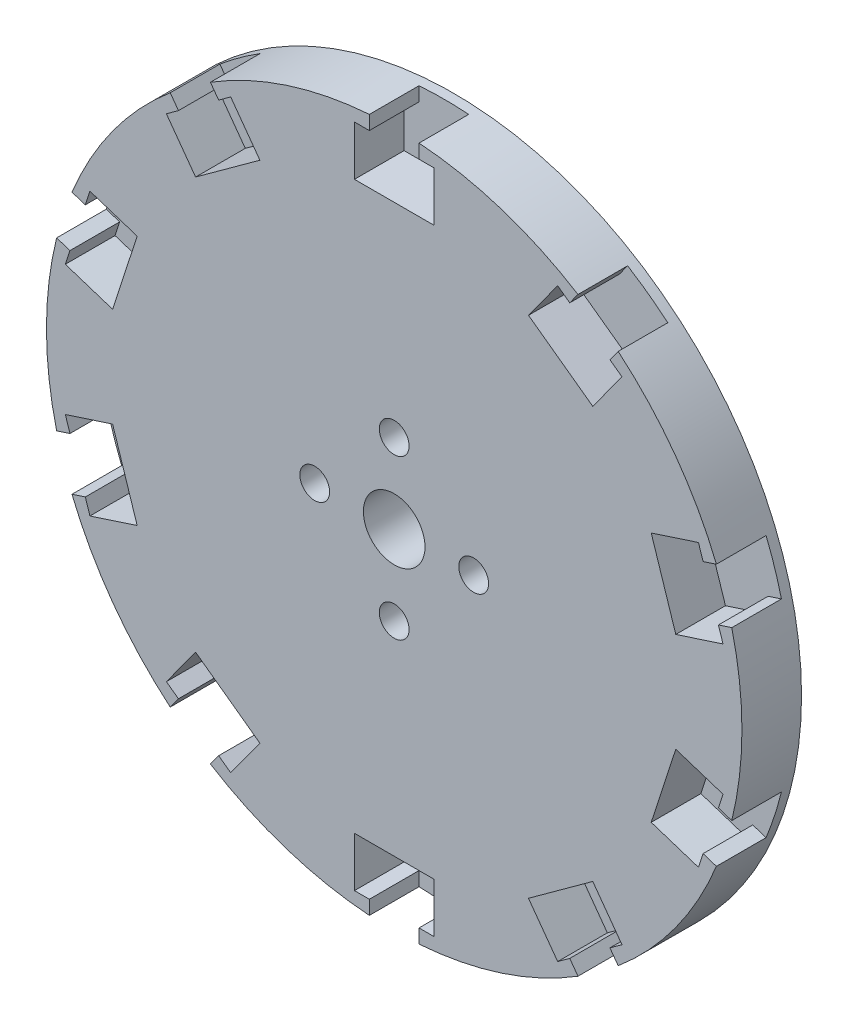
ISO-10303-21;
HEADER;
FILE_DESCRIPTION(('STEP AP214'),'2;1');
FILE_NAME('part.step','',(''),(''),'','','');
FILE_SCHEMA(('AUTOMOTIVE_DESIGN { 1 0 10303 214 1 1 1 1 }'));
ENDSEC;
DATA;
#1=APPLICATION_CONTEXT('core data for automotive mechanical design processes');
#2=APPLICATION_PROTOCOL_DEFINITION('international standard','automotive_design',2000,#1);
#3=PRODUCT_CONTEXT('',#1,'mechanical');
#4=PRODUCT('Part','Part','',(#3));
#5=PRODUCT_RELATED_PRODUCT_CATEGORY('part','',(#4));
#6=PRODUCT_DEFINITION_FORMATION('','',#4);
#7=PRODUCT_DEFINITION_CONTEXT('part definition',#1,'design');
#8=PRODUCT_DEFINITION('design','',#6,#7);
#9=PRODUCT_DEFINITION_SHAPE('','',#8);
#10=(LENGTH_UNIT() NAMED_UNIT(*) SI_UNIT(.MILLI.,.METRE.));
#11=(NAMED_UNIT(*) PLANE_ANGLE_UNIT() SI_UNIT($,.RADIAN.));
#12=(NAMED_UNIT(*) SI_UNIT($,.STERADIAN.) SOLID_ANGLE_UNIT());
#13=UNCERTAINTY_MEASURE_WITH_UNIT(LENGTH_MEASURE(1.E-05),#10,'distance_accuracy_value','');
#14=(GEOMETRIC_REPRESENTATION_CONTEXT(3) GLOBAL_UNCERTAINTY_ASSIGNED_CONTEXT((#13)) GLOBAL_UNIT_ASSIGNED_CONTEXT((#10,
#11,#12)) REPRESENTATION_CONTEXT('',''));
#15=CARTESIAN_POINT('',(0.,0.,0.));
#16=DIRECTION('',(0.,0.,1.));
#17=DIRECTION('',(1.,0.,0.));
#18=AXIS2_PLACEMENT_3D('',#15,#16,#17);
#19=CARTESIAN_POINT('',(0.,0.,6.));
#20=DIRECTION('',(0.,0.,1.));
#21=DIRECTION('',(1.,0.,0.));
#22=AXIS2_PLACEMENT_3D('',#19,#20,#21);
#23=PLANE('',#22);
#24=DIRECTION('',(-0.587785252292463,0.809016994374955,0.));
#25=VECTOR('',#24,1.);
#26=CARTESIAN_POINT('',(-21.7216843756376,34.1505876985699,6.));
#27=LINE('',#26,#25);
#28=CARTESIAN_POINT('',(-17.6682634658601,28.5715324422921,6.));
#29=VERTEX_POINT('',#28);
#30=CARTESIAN_POINT('',(-18.4973934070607,29.712731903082,6.));
#31=VERTEX_POINT('',#30);
#32=EDGE_CURVE('E538',#29,#31,#27,.T.);
#33=ORIENTED_EDGE('',*,*,#32,.F.);
#34=DIRECTION('',(-0.809016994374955,-0.587785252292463,0.));
#35=VECTOR('',#34,1.);
#36=CARTESIAN_POINT('',(-17.6682634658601,28.5715324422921,6.));
#37=LINE('',#36,#35);
#38=CARTESIAN_POINT('',(-16.4547379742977,29.4532103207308,6.));
#39=VERTEX_POINT('',#38);
#40=EDGE_CURVE('E564',#39,#29,#37,.T.);
#41=ORIENTED_EDGE('',*,*,#40,.F.);
#42=DIRECTION('',(-0.587785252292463,0.809016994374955,0.));
#43=VECTOR('',#42,1.);
#44=CARTESIAN_POINT('',(-16.4547379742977,29.4532103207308,6.));
#45=LINE('',#44,#43);
#46=CARTESIAN_POINT('',(-13.5158117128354,25.4081253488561,6.));
#47=VERTEX_POINT('',#46);
#48=EDGE_CURVE('E561',#47,#39,#45,.T.);
#49=ORIENTED_EDGE('',*,*,#48,.F.);
#50=DIRECTION('',(0.809016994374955,0.587785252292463,0.));
#51=VECTOR('',#50,1.);
#52=CARTESIAN_POINT('',(-19.987947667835,20.7058433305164,6.));
#53=LINE('',#52,#51);
#54=CARTESIAN_POINT('',(-19.987947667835,20.7058433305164,6.));
#55=VERTEX_POINT('',#54);
#56=EDGE_CURVE('E555',#55,#47,#53,.T.);
#57=ORIENTED_EDGE('',*,*,#56,.F.);
#58=DIRECTION('',(0.587785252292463,-0.809016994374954,0.));
#59=VECTOR('',#58,1.);
#60=CARTESIAN_POINT('',(-22.9268739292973,24.7509283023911,6.));
#61=LINE('',#60,#59);
#62=CARTESIAN_POINT('',(-22.9268739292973,24.7509283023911,6.));
#63=VERTEX_POINT('',#62);
#64=EDGE_CURVE('E553',#63,#55,#61,.T.);
#65=ORIENTED_EDGE('',*,*,#64,.F.);
#66=DIRECTION('',(-0.809016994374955,-0.587785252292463,0.));
#67=VECTOR('',#66,1.);
#68=CARTESIAN_POINT('',(-22.9268739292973,24.7509283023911,6.));
#69=LINE('',#68,#67);
#70=CARTESIAN_POINT('',(-21.7133484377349,25.6326061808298,6.));
#71=VERTEX_POINT('',#70);
#72=EDGE_CURVE('E537',#71,#63,#69,.T.);
#73=ORIENTED_EDGE('',*,*,#72,.F.);
#74=DIRECTION('',(0.587785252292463,-0.809016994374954,0.));
#75=VECTOR('',#74,1.);
#76=CARTESIAN_POINT('',(-25.7667693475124,31.2116614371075,6.));
#77=LINE('',#76,#75);
#78=CARTESIAN_POINT('',(-22.5424783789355,26.7738056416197,6.));
#79=VERTEX_POINT('',#78);
#80=EDGE_CURVE('E527',#79,#71,#77,.T.);
#81=ORIENTED_EDGE('',*,*,#80,.F.);
#82=CARTESIAN_POINT('',(0.,0.,6.));
#83=DIRECTION('',(0.,0.,1.));
#84=DIRECTION('',(1.,0.,0.));
#85=AXIS2_PLACEMENT_3D('',#82,#83,#84);
#86=CIRCLE('',#85,35.);
#87=CARTESIAN_POINT('',(-32.4294112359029,13.1656100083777,6.));
#88=VERTEX_POINT('',#87);
#89=EDGE_CURVE('E1094',#79,#88,#86,.T.);
#90=ORIENTED_EDGE('',*,*,#89,.T.);
#91=DIRECTION('',(-0.95105651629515,0.309016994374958,0.));
#92=VECTOR('',#91,1.);
#93=CARTESIAN_POINT('',(-37.6464236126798,14.8607200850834,6.));
#94=LINE('',#93,#92);
#95=CARTESIAN_POINT('',(-31.0878508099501,12.729710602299,6.));
#96=VERTEX_POINT('',#95);
#97=EDGE_CURVE('E583',#96,#88,#94,.T.);
#98=ORIENTED_EDGE('',*,*,#97,.F.);
#99=DIRECTION('',(-0.309016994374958,-0.95105651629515,0.));
#100=VECTOR('',#99,1.);
#101=CARTESIAN_POINT('',(-31.0878508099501,12.729710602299,6.));
#102=LINE('',#101,#100);
#103=CARTESIAN_POINT('',(-30.6243253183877,14.1562953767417,6.));
#104=VERTEX_POINT('',#103);
#105=EDGE_CURVE('E607',#104,#96,#102,.T.);
#106=ORIENTED_EDGE('',*,*,#105,.F.);
#107=DIRECTION('',(-0.95105651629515,0.309016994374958,0.));
#108=VECTOR('',#107,1.);
#109=CARTESIAN_POINT('',(-30.6243253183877,14.1562953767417,6.));
#110=LINE('',#109,#108);
#111=CARTESIAN_POINT('',(-25.8690427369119,12.6112104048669,6.));
#112=VERTEX_POINT('',#111);
#113=EDGE_CURVE('E604',#112,#104,#110,.T.);
#114=ORIENTED_EDGE('',*,*,#113,.F.);
#115=DIRECTION('',(0.309016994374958,0.95105651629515,0.));
#116=VECTOR('',#115,1.);
#117=CARTESIAN_POINT('',(-28.3411786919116,5.00275827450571,6.));
#118=LINE('',#117,#116);
#119=CARTESIAN_POINT('',(-28.3411786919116,5.00275827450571,6.));
#120=VERTEX_POINT('',#119);
#121=EDGE_CURVE('E601',#120,#112,#118,.T.);
#122=ORIENTED_EDGE('',*,*,#121,.F.);
#123=DIRECTION('',(0.95105651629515,-0.309016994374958,0.));
#124=VECTOR('',#123,1.);
#125=CARTESIAN_POINT('',(-33.0964612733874,6.5478432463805,6.));
#126=LINE('',#125,#124);
#127=CARTESIAN_POINT('',(-33.0964612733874,6.5478432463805,6.));
#128=VERTEX_POINT('',#127);
#129=EDGE_CURVE('E598',#128,#120,#126,.T.);
#130=ORIENTED_EDGE('',*,*,#129,.F.);
#131=DIRECTION('',(-0.309016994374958,-0.95105651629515,0.));
#132=VECTOR('',#131,1.);
#133=CARTESIAN_POINT('',(-33.0964612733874,6.5478432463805,6.));
#134=LINE('',#133,#132);
#135=CARTESIAN_POINT('',(-32.6329357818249,7.97442802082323,6.));
#136=VERTEX_POINT('',#135);
#137=EDGE_CURVE('E595',#136,#128,#134,.T.);
#138=ORIENTED_EDGE('',*,*,#137,.F.);
#139=DIRECTION('',(0.95105651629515,-0.309016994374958,0.));
#140=VECTOR('',#139,1.);
#141=CARTESIAN_POINT('',(-39.1915085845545,10.1054375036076,6.));
#142=LINE('',#141,#140);
#143=CARTESIAN_POINT('',(-33.9744962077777,8.41032742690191,6.));
#144=VERTEX_POINT('',#143);
#145=EDGE_CURVE('E593',#144,#136,#142,.T.);
#146=ORIENTED_EDGE('',*,*,#145,.F.);
#147=CARTESIAN_POINT('',(-33.9744962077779,-8.4103274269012,6.));
#148=VERTEX_POINT('',#147);
#149=EDGE_CURVE('E1172',#144,#148,#86,.T.);
#150=ORIENTED_EDGE('',*,*,#149,.T.);
#151=DIRECTION('',(-0.951056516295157,-0.309016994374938,0.));
#152=VECTOR('',#151,1.);
#153=CARTESIAN_POINT('',(-39.1915085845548,-10.1054375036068,6.));
#154=LINE('',#153,#152);
#155=CARTESIAN_POINT('',(-32.6329357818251,-7.97442802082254,6.));
#156=VERTEX_POINT('',#155);
#157=EDGE_CURVE('E630',#156,#148,#154,.T.);
#158=ORIENTED_EDGE('',*,*,#157,.F.);
#159=DIRECTION('',(0.309016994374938,-0.951056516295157,0.));
#160=VECTOR('',#159,1.);
#161=CARTESIAN_POINT('',(-32.6329357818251,-7.97442802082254,6.));
#162=LINE('',#161,#160);
#163=CARTESIAN_POINT('',(-33.0964612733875,-6.54784324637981,6.));
#164=VERTEX_POINT('',#163);
#165=EDGE_CURVE('E657',#164,#156,#162,.T.);
#166=ORIENTED_EDGE('',*,*,#165,.F.);
#167=DIRECTION('',(-0.951056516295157,-0.309016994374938,0.));
#168=VECTOR('',#167,1.);
#169=CARTESIAN_POINT('',(-33.0964612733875,-6.54784324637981,6.));
#170=LINE('',#169,#168);
#171=CARTESIAN_POINT('',(-28.3411786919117,-5.00275827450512,6.));
#172=VERTEX_POINT('',#171);
#173=EDGE_CURVE('E654',#172,#164,#170,.T.);
#174=ORIENTED_EDGE('',*,*,#173,.F.);
#175=DIRECTION('',(-0.309016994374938,0.951056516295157,0.));
#176=VECTOR('',#175,1.);
#177=CARTESIAN_POINT('',(-25.8690427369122,-12.6112104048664,6.));
#178=LINE('',#177,#176);
#179=CARTESIAN_POINT('',(-25.8690427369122,-12.6112104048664,6.));
#180=VERTEX_POINT('',#179);
#181=EDGE_CURVE('E651',#180,#172,#178,.T.);
#182=ORIENTED_EDGE('',*,*,#181,.F.);
#183=DIRECTION('',(0.951056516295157,0.309016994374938,0.));
#184=VECTOR('',#183,1.);
#185=CARTESIAN_POINT('',(-30.624325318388,-14.1562953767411,6.));
#186=LINE('',#185,#184);
#187=CARTESIAN_POINT('',(-30.624325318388,-14.1562953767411,6.));
#188=VERTEX_POINT('',#187);
#189=EDGE_CURVE('E648',#188,#180,#186,.T.);
#190=ORIENTED_EDGE('',*,*,#189,.F.);
#191=DIRECTION('',(0.309016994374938,-0.951056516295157,0.));
#192=VECTOR('',#191,1.);
#193=CARTESIAN_POINT('',(-30.624325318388,-14.1562953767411,6.));
#194=LINE('',#193,#192);
#195=CARTESIAN_POINT('',(-31.0878508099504,-12.7297106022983,6.));
#196=VERTEX_POINT('',#195);
#197=EDGE_CURVE('E645',#196,#188,#194,.T.);
#198=ORIENTED_EDGE('',*,*,#197,.F.);
#199=DIRECTION('',(0.951056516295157,0.309016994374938,0.));
#200=VECTOR('',#199,1.);
#201=CARTESIAN_POINT('',(-37.6464236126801,-14.8607200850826,6.));
#202=LINE('',#201,#200);
#203=CARTESIAN_POINT('',(-32.4294112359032,-13.165610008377,6.));
#204=VERTEX_POINT('',#203);
#205=EDGE_CURVE('E643',#204,#196,#202,.T.);
#206=ORIENTED_EDGE('',*,*,#205,.F.);
#207=CARTESIAN_POINT('',(-22.5424783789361,-26.7738056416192,6.));
#208=VERTEX_POINT('',#207);
#209=EDGE_CURVE('E1173',#204,#208,#86,.T.);
#210=ORIENTED_EDGE('',*,*,#209,.T.);
#211=DIRECTION('',(-0.58778525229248,-0.809016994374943,0.));
#212=VECTOR('',#211,1.);
#213=CARTESIAN_POINT('',(-25.7667693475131,-31.211661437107,6.));
#214=LINE('',#213,#212);
#215=CARTESIAN_POINT('',(-21.7133484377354,-25.6326061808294,6.));
#216=VERTEX_POINT('',#215);
#217=EDGE_CURVE('E682',#216,#208,#214,.T.);
#218=ORIENTED_EDGE('',*,*,#217,.F.);
#219=DIRECTION('',(0.809016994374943,-0.58778525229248,0.));
#220=VECTOR('',#219,1.);
#221=CARTESIAN_POINT('',(-21.7133484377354,-25.6326061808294,6.));
#222=LINE('',#221,#220);
#223=CARTESIAN_POINT('',(-22.9268739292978,-24.7509283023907,6.));
#224=VERTEX_POINT('',#223);
#225=EDGE_CURVE('E709',#224,#216,#222,.T.);
#226=ORIENTED_EDGE('',*,*,#225,.F.);
#227=DIRECTION('',(-0.58778525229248,-0.809016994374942,0.));
#228=VECTOR('',#227,1.);
#229=CARTESIAN_POINT('',(-22.9268739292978,-24.7509283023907,6.));
#230=LINE('',#229,#228);
#231=CARTESIAN_POINT('',(-19.9879476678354,-20.7058433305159,6.));
#232=VERTEX_POINT('',#231);
#233=EDGE_CURVE('E706',#232,#224,#230,.T.);
#234=ORIENTED_EDGE('',*,*,#233,.F.);
#235=DIRECTION('',(-0.809016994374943,0.58778525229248,0.));
#236=VECTOR('',#235,1.);
#237=CARTESIAN_POINT('',(-13.5158117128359,-25.4081253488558,6.));
#238=LINE('',#237,#236);
#239=CARTESIAN_POINT('',(-13.5158117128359,-25.4081253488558,6.));
#240=VERTEX_POINT('',#239);
#241=EDGE_CURVE('E703',#240,#232,#238,.T.);
#242=ORIENTED_EDGE('',*,*,#241,.F.);
#243=DIRECTION('',(0.58778525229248,0.809016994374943,0.));
#244=VECTOR('',#243,1.);
#245=CARTESIAN_POINT('',(-16.4547379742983,-29.4532103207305,6.));
#246=LINE('',#245,#244);
#247=CARTESIAN_POINT('',(-16.4547379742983,-29.4532103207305,6.));
#248=VERTEX_POINT('',#247);
#249=EDGE_CURVE('E700',#248,#240,#246,.T.);
#250=ORIENTED_EDGE('',*,*,#249,.F.);
#251=DIRECTION('',(0.809016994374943,-0.58778525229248,0.));
#252=VECTOR('',#251,1.);
#253=CARTESIAN_POINT('',(-16.4547379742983,-29.4532103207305,6.));
#254=LINE('',#253,#252);
#255=CARTESIAN_POINT('',(-17.6682634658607,-28.5715324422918,6.));
#256=VERTEX_POINT('',#255);
#257=EDGE_CURVE('E697',#256,#248,#254,.T.);
#258=ORIENTED_EDGE('',*,*,#257,.F.);
#259=DIRECTION('',(0.58778525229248,0.809016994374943,0.));
#260=VECTOR('',#259,1.);
#261=CARTESIAN_POINT('',(-21.7216843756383,-34.1505876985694,6.));
#262=LINE('',#261,#260);
#263=CARTESIAN_POINT('',(-18.4973934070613,-29.7127319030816,6.));
#264=VERTEX_POINT('',#263);
#265=EDGE_CURVE('E695',#264,#256,#262,.T.);
#266=ORIENTED_EDGE('',*,*,#265,.F.);
#267=CARTESIAN_POINT('',(-2.50000000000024,-34.9106001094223,6.));
#268=VERTEX_POINT('',#267);
#269=EDGE_CURVE('E1177',#264,#268,#86,.T.);
#270=ORIENTED_EDGE('',*,*,#269,.T.);
#271=DIRECTION('',(0.,-1.,0.));
#272=VECTOR('',#271,1.);
#273=CARTESIAN_POINT('',(-2.50000000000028,-40.3960915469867,6.));
#274=LINE('',#273,#272);
#275=CARTESIAN_POINT('',(-2.50000000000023,-33.5,6.));
#276=VERTEX_POINT('',#275);
#277=EDGE_CURVE('E734',#276,#268,#274,.T.);
#278=ORIENTED_EDGE('',*,*,#277,.F.);
#279=DIRECTION('',(1.,0.,0.));
#280=VECTOR('',#279,1.);
#281=CARTESIAN_POINT('',(-2.50000000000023,-33.5,6.));
#282=LINE('',#281,#280);
#283=CARTESIAN_POINT('',(-4.00000000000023,-33.5,6.));
#284=VERTEX_POINT('',#283);
#285=EDGE_CURVE('E761',#284,#276,#282,.T.);
#286=ORIENTED_EDGE('',*,*,#285,.F.);
#287=DIRECTION('',(0.,-1.,0.));
#288=VECTOR('',#287,1.);
#289=CARTESIAN_POINT('',(-4.00000000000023,-33.5,6.));
#290=LINE('',#289,#288);
#291=CARTESIAN_POINT('',(-4.0000000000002,-28.5,6.));
#292=VERTEX_POINT('',#291);
#293=EDGE_CURVE('E758',#292,#284,#290,.T.);
#294=ORIENTED_EDGE('',*,*,#293,.F.);
#295=DIRECTION('',(-1.,0.,0.));
#296=VECTOR('',#295,1.);
#297=CARTESIAN_POINT('',(3.9999999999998,-28.5,6.));
#298=LINE('',#297,#296);
#299=CARTESIAN_POINT('',(3.9999999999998,-28.5,6.));
#300=VERTEX_POINT('',#299);
#301=EDGE_CURVE('E755',#300,#292,#298,.T.);
#302=ORIENTED_EDGE('',*,*,#301,.F.);
#303=DIRECTION('',(0.,1.,0.));
#304=VECTOR('',#303,1.);
#305=CARTESIAN_POINT('',(3.99999999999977,-33.5,6.));
#306=LINE('',#305,#304);
#307=CARTESIAN_POINT('',(3.99999999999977,-33.5,6.));
#308=VERTEX_POINT('',#307);
#309=EDGE_CURVE('E752',#308,#300,#306,.T.);
#310=ORIENTED_EDGE('',*,*,#309,.F.);
#311=DIRECTION('',(1.,0.,0.));
#312=VECTOR('',#311,1.);
#313=CARTESIAN_POINT('',(3.99999999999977,-33.5,6.));
#314=LINE('',#313,#312);
#315=CARTESIAN_POINT('',(2.49999999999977,-33.5,6.));
#316=VERTEX_POINT('',#315);
#317=EDGE_CURVE('E749',#316,#308,#314,.T.);
#318=ORIENTED_EDGE('',*,*,#317,.F.);
#319=DIRECTION('',(0.,1.,0.));
#320=VECTOR('',#319,1.);
#321=CARTESIAN_POINT('',(2.49999999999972,-40.3960915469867,6.));
#322=LINE('',#321,#320);
#323=CARTESIAN_POINT('',(2.49999999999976,-34.9106001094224,6.));
#324=VERTEX_POINT('',#323);
#325=EDGE_CURVE('E747',#324,#316,#322,.T.);
#326=ORIENTED_EDGE('',*,*,#325,.F.);
#327=CARTESIAN_POINT('',(18.4973934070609,-29.7127319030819,6.));
#328=VERTEX_POINT('',#327);
#329=EDGE_CURVE('E1181',#324,#328,#86,.T.);
#330=ORIENTED_EDGE('',*,*,#329,.T.);
#331=DIRECTION('',(0.587785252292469,-0.809016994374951,0.));
#332=VECTOR('',#331,1.);
#333=CARTESIAN_POINT('',(21.7216843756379,-34.1505876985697,6.));
#334=LINE('',#333,#332);
#335=CARTESIAN_POINT('',(17.6682634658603,-28.571532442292,6.));
#336=VERTEX_POINT('',#335);
#337=EDGE_CURVE('E786',#336,#328,#334,.T.);
#338=ORIENTED_EDGE('',*,*,#337,.F.);
#339=DIRECTION('',(0.809016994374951,0.587785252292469,0.));
#340=VECTOR('',#339,1.);
#341=CARTESIAN_POINT('',(17.6682634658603,-28.571532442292,6.));
#342=LINE('',#341,#340);
#343=CARTESIAN_POINT('',(16.4547379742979,-29.4532103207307,6.));
#344=VERTEX_POINT('',#343);
#345=EDGE_CURVE('E813',#344,#336,#342,.T.);
#346=ORIENTED_EDGE('',*,*,#345,.F.);
#347=DIRECTION('',(0.587785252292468,-0.809016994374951,0.));
#348=VECTOR('',#347,1.);
#349=CARTESIAN_POINT('',(16.4547379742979,-29.4532103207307,6.));
#350=LINE('',#349,#348);
#351=CARTESIAN_POINT('',(13.5158117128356,-25.408125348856,6.));
#352=VERTEX_POINT('',#351);
#353=EDGE_CURVE('E810',#352,#344,#350,.T.);
#354=ORIENTED_EDGE('',*,*,#353,.F.);
#355=DIRECTION('',(-0.809016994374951,-0.587785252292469,0.));
#356=VECTOR('',#355,1.);
#357=CARTESIAN_POINT('',(19.9879476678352,-20.7058433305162,6.));
#358=LINE('',#357,#356);
#359=CARTESIAN_POINT('',(19.9879476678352,-20.7058433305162,6.));
#360=VERTEX_POINT('',#359);
#361=EDGE_CURVE('E807',#360,#352,#358,.T.);
#362=ORIENTED_EDGE('',*,*,#361,.F.);
#363=DIRECTION('',(-0.587785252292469,0.809016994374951,0.));
#364=VECTOR('',#363,1.);
#365=CARTESIAN_POINT('',(22.9268739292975,-24.750928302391,6.));
#366=LINE('',#365,#364);
#367=CARTESIAN_POINT('',(22.9268739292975,-24.750928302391,6.));
#368=VERTEX_POINT('',#367);
#369=EDGE_CURVE('E804',#368,#360,#366,.T.);
#370=ORIENTED_EDGE('',*,*,#369,.F.);
#371=DIRECTION('',(0.809016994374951,0.587785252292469,0.));
#372=VECTOR('',#371,1.);
#373=CARTESIAN_POINT('',(22.9268739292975,-24.750928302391,6.));
#374=LINE('',#373,#372);
#375=CARTESIAN_POINT('',(21.7133484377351,-25.6326061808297,6.));
#376=VERTEX_POINT('',#375);
#377=EDGE_CURVE('E801',#376,#368,#374,.T.);
#378=ORIENTED_EDGE('',*,*,#377,.F.);
#379=DIRECTION('',(-0.587785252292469,0.809016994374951,0.));
#380=VECTOR('',#379,1.);
#381=CARTESIAN_POINT('',(25.7667693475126,-31.2116614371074,6.));
#382=LINE('',#381,#380);
#383=CARTESIAN_POINT('',(22.5424783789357,-26.7738056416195,6.));
#384=VERTEX_POINT('',#383);
#385=EDGE_CURVE('E799',#384,#376,#382,.T.);
#386=ORIENTED_EDGE('',*,*,#385,.F.);
#387=CARTESIAN_POINT('',(32.429411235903,-13.1656100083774,6.));
#388=VERTEX_POINT('',#387);
#389=EDGE_CURVE('E1185',#384,#388,#86,.T.);
#390=ORIENTED_EDGE('',*,*,#389,.T.);
#391=DIRECTION('',(0.951056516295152,-0.309016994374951,0.));
#392=VECTOR('',#391,1.);
#393=CARTESIAN_POINT('',(37.6464236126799,-14.8607200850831,6.));
#394=LINE('',#393,#392);
#395=CARTESIAN_POINT('',(31.0878508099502,-12.7297106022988,6.));
#396=VERTEX_POINT('',#395);
#397=EDGE_CURVE('E838',#396,#388,#394,.T.);
#398=ORIENTED_EDGE('',*,*,#397,.F.);
#399=DIRECTION('',(0.309016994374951,0.951056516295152,0.));
#400=VECTOR('',#399,1.);
#401=CARTESIAN_POINT('',(31.0878508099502,-12.7297106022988,6.));
#402=LINE('',#401,#400);
#403=CARTESIAN_POINT('',(30.6243253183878,-14.1562953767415,6.));
#404=VERTEX_POINT('',#403);
#405=EDGE_CURVE('E865',#404,#396,#402,.T.);
#406=ORIENTED_EDGE('',*,*,#405,.F.);
#407=DIRECTION('',(0.951056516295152,-0.309016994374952,0.));
#408=VECTOR('',#407,1.);
#409=CARTESIAN_POINT('',(30.6243253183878,-14.1562953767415,6.));
#410=LINE('',#409,#408);
#411=CARTESIAN_POINT('',(25.869042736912,-12.6112104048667,6.));
#412=VERTEX_POINT('',#411);
#413=EDGE_CURVE('E862',#412,#404,#410,.T.);
#414=ORIENTED_EDGE('',*,*,#413,.F.);
#415=DIRECTION('',(-0.309016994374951,-0.951056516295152,0.));
#416=VECTOR('',#415,1.);
#417=CARTESIAN_POINT('',(28.3411786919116,-5.00275827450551,6.));
#418=LINE('',#417,#416);
#419=CARTESIAN_POINT('',(28.3411786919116,-5.00275827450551,6.));
#420=VERTEX_POINT('',#419);
#421=EDGE_CURVE('E859',#420,#412,#418,.T.);
#422=ORIENTED_EDGE('',*,*,#421,.F.);
#423=DIRECTION('',(-0.951056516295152,0.309016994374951,0.));
#424=VECTOR('',#423,1.);
#425=CARTESIAN_POINT('',(33.0964612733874,-6.54784324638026,6.));
#426=LINE('',#425,#424);
#427=CARTESIAN_POINT('',(33.0964612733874,-6.54784324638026,6.));
#428=VERTEX_POINT('',#427);
#429=EDGE_CURVE('E856',#428,#420,#426,.T.);
#430=ORIENTED_EDGE('',*,*,#429,.F.);
#431=DIRECTION('',(0.309016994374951,0.951056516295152,0.));
#432=VECTOR('',#431,1.);
#433=CARTESIAN_POINT('',(33.0964612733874,-6.54784324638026,6.));
#434=LINE('',#433,#432);
#435=CARTESIAN_POINT('',(32.632935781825,-7.97442802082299,6.));
#436=VERTEX_POINT('',#435);
#437=EDGE_CURVE('E853',#436,#428,#434,.T.);
#438=ORIENTED_EDGE('',*,*,#437,.F.);
#439=DIRECTION('',(-0.951056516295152,0.309016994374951,0.));
#440=VECTOR('',#439,1.);
#441=CARTESIAN_POINT('',(39.1915085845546,-10.1054375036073,6.));
#442=LINE('',#441,#440);
#443=CARTESIAN_POINT('',(33.9744962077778,-8.41032742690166,6.));
#444=VERTEX_POINT('',#443);
#445=EDGE_CURVE('E851',#444,#436,#442,.T.);
#446=ORIENTED_EDGE('',*,*,#445,.F.);
#447=CARTESIAN_POINT('',(33.9744962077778,8.41032742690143,6.));
#448=VERTEX_POINT('',#447);
#449=EDGE_CURVE('E1189',#444,#448,#86,.T.);
#450=ORIENTED_EDGE('',*,*,#449,.T.);
#451=DIRECTION('',(0.951056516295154,0.309016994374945,0.));
#452=VECTOR('',#451,1.);
#453=CARTESIAN_POINT('',(39.1915085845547,10.1054375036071,6.));
#454=LINE('',#453,#452);
#455=CARTESIAN_POINT('',(32.632935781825,7.97442802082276,6.));
#456=VERTEX_POINT('',#455);
#457=EDGE_CURVE('E890',#456,#448,#454,.T.);
#458=ORIENTED_EDGE('',*,*,#457,.F.);
#459=DIRECTION('',(-0.309016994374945,0.951056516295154,0.));
#460=VECTOR('',#459,1.);
#461=CARTESIAN_POINT('',(32.632935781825,7.97442802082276,6.));
#462=LINE('',#461,#460);
#463=CARTESIAN_POINT('',(33.0964612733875,6.54784324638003,6.));
#464=VERTEX_POINT('',#463);
#465=EDGE_CURVE('E917',#464,#456,#462,.T.);
#466=ORIENTED_EDGE('',*,*,#465,.F.);
#467=DIRECTION('',(0.951056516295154,0.309016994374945,0.));
#468=VECTOR('',#467,1.);
#469=CARTESIAN_POINT('',(33.0964612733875,6.54784324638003,6.));
#470=LINE('',#469,#468);
#471=CARTESIAN_POINT('',(28.3411786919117,5.00275827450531,6.));
#472=VERTEX_POINT('',#471);
#473=EDGE_CURVE('E914',#472,#464,#470,.T.);
#474=ORIENTED_EDGE('',*,*,#473,.F.);
#475=DIRECTION('',(0.309016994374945,-0.951056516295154,0.));
#476=VECTOR('',#475,1.);
#477=CARTESIAN_POINT('',(25.8690427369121,12.6112104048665,6.));
#478=LINE('',#477,#476);
#479=CARTESIAN_POINT('',(25.8690427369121,12.6112104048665,6.));
#480=VERTEX_POINT('',#479);
#481=EDGE_CURVE('E911',#480,#472,#478,.T.);
#482=ORIENTED_EDGE('',*,*,#481,.F.);
#483=DIRECTION('',(-0.951056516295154,-0.309016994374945,0.));
#484=VECTOR('',#483,1.);
#485=CARTESIAN_POINT('',(30.6243253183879,14.1562953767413,6.));
#486=LINE('',#485,#484);
#487=CARTESIAN_POINT('',(30.6243253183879,14.1562953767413,6.));
#488=VERTEX_POINT('',#487);
#489=EDGE_CURVE('E908',#488,#480,#486,.T.);
#490=ORIENTED_EDGE('',*,*,#489,.F.);
#491=DIRECTION('',(-0.309016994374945,0.951056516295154,0.));
#492=VECTOR('',#491,1.);
#493=CARTESIAN_POINT('',(30.6243253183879,14.1562953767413,6.));
#494=LINE('',#493,#492);
#495=CARTESIAN_POINT('',(31.0878508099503,12.7297106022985,6.));
#496=VERTEX_POINT('',#495);
#497=EDGE_CURVE('E905',#496,#488,#494,.T.);
#498=ORIENTED_EDGE('',*,*,#497,.F.);
#499=DIRECTION('',(-0.951056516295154,-0.309016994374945,0.));
#500=VECTOR('',#499,1.);
#501=CARTESIAN_POINT('',(37.64642361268,14.8607200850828,6.));
#502=LINE('',#501,#500);
#503=CARTESIAN_POINT('',(32.4294112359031,13.1656100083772,6.));
#504=VERTEX_POINT('',#503);
#505=EDGE_CURVE('E903',#504,#496,#502,.T.);
#506=ORIENTED_EDGE('',*,*,#505,.F.);
#507=CARTESIAN_POINT('',(22.5424783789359,26.7738056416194,6.));
#508=VERTEX_POINT('',#507);
#509=EDGE_CURVE('E1193',#504,#508,#86,.T.);
#510=ORIENTED_EDGE('',*,*,#509,.T.);
#511=DIRECTION('',(0.587785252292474,0.809016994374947,0.));
#512=VECTOR('',#511,1.);
#513=CARTESIAN_POINT('',(25.7667693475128,31.2116614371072,6.));
#514=LINE('',#513,#512);
#515=CARTESIAN_POINT('',(21.7133484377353,25.6326061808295,6.));
#516=VERTEX_POINT('',#515);
#517=EDGE_CURVE('E942',#516,#508,#514,.T.);
#518=ORIENTED_EDGE('',*,*,#517,.F.);
#519=DIRECTION('',(-0.809016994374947,0.587785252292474,0.));
#520=VECTOR('',#519,1.);
#521=CARTESIAN_POINT('',(21.7133484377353,25.6326061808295,6.));
#522=LINE('',#521,#520);
#523=CARTESIAN_POINT('',(22.9268739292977,24.7509283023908,6.));
#524=VERTEX_POINT('',#523);
#525=EDGE_CURVE('E969',#524,#516,#522,.T.);
#526=ORIENTED_EDGE('',*,*,#525,.F.);
#527=DIRECTION('',(0.587785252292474,0.809016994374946,0.));
#528=VECTOR('',#527,1.);
#529=CARTESIAN_POINT('',(22.9268739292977,24.7509283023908,6.));
#530=LINE('',#529,#528);
#531=CARTESIAN_POINT('',(19.9879476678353,20.7058433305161,6.));
#532=VERTEX_POINT('',#531);
#533=EDGE_CURVE('E966',#532,#524,#530,.T.);
#534=ORIENTED_EDGE('',*,*,#533,.F.);
#535=DIRECTION('',(0.809016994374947,-0.587785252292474,0.));
#536=VECTOR('',#535,1.);
#537=CARTESIAN_POINT('',(13.5158117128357,25.4081253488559,6.));
#538=LINE('',#537,#536);
#539=CARTESIAN_POINT('',(13.5158117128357,25.4081253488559,6.));
#540=VERTEX_POINT('',#539);
#541=EDGE_CURVE('E963',#540,#532,#538,.T.);
#542=ORIENTED_EDGE('',*,*,#541,.F.);
#543=DIRECTION('',(-0.587785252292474,-0.809016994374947,0.));
#544=VECTOR('',#543,1.);
#545=CARTESIAN_POINT('',(16.4547379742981,29.4532103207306,6.));
#546=LINE('',#545,#544);
#547=CARTESIAN_POINT('',(16.4547379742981,29.4532103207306,6.));
#548=VERTEX_POINT('',#547);
#549=EDGE_CURVE('E960',#548,#540,#546,.T.);
#550=ORIENTED_EDGE('',*,*,#549,.F.);
#551=DIRECTION('',(-0.809016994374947,0.587785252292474,0.));
#552=VECTOR('',#551,1.);
#553=CARTESIAN_POINT('',(16.4547379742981,29.4532103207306,6.));
#554=LINE('',#553,#552);
#555=CARTESIAN_POINT('',(17.6682634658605,28.5715324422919,6.));
#556=VERTEX_POINT('',#555);
#557=EDGE_CURVE('E957',#556,#548,#554,.T.);
#558=ORIENTED_EDGE('',*,*,#557,.F.);
#559=DIRECTION('',(-0.587785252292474,-0.809016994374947,0.));
#560=VECTOR('',#559,1.);
#561=CARTESIAN_POINT('',(21.7216843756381,34.1505876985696,6.));
#562=LINE('',#561,#560);
#563=CARTESIAN_POINT('',(18.4973934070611,29.7127319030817,6.));
#564=VERTEX_POINT('',#563);
#565=EDGE_CURVE('E955',#564,#556,#562,.T.);
#566=ORIENTED_EDGE('',*,*,#565,.F.);
#567=CARTESIAN_POINT('',(2.5,34.9106001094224,6.));
#568=VERTEX_POINT('',#567);
#569=EDGE_CURVE('E1089',#564,#568,#86,.T.);
#570=ORIENTED_EDGE('',*,*,#569,.T.);
#571=DIRECTION('',(0.,1.,0.));
#572=VECTOR('',#571,1.);
#573=CARTESIAN_POINT('',(2.5,40.3960915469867,6.));
#574=LINE('',#573,#572);
#575=CARTESIAN_POINT('',(2.5,33.5,6.));
#576=VERTEX_POINT('',#575);
#577=EDGE_CURVE('E994',#576,#568,#574,.T.);
#578=ORIENTED_EDGE('',*,*,#577,.F.);
#579=DIRECTION('',(-1.,0.,0.));
#580=VECTOR('',#579,1.);
#581=CARTESIAN_POINT('',(2.5,33.5,6.));
#582=LINE('',#581,#580);
#583=CARTESIAN_POINT('',(4.,33.5,6.));
#584=VERTEX_POINT('',#583);
#585=EDGE_CURVE('E1021',#584,#576,#582,.T.);
#586=ORIENTED_EDGE('',*,*,#585,.F.);
#587=DIRECTION('',(0.,1.,0.));
#588=VECTOR('',#587,1.);
#589=CARTESIAN_POINT('',(4.,33.5,6.));
#590=LINE('',#589,#588);
#591=CARTESIAN_POINT('',(4.,28.5,6.));
#592=VERTEX_POINT('',#591);
#593=EDGE_CURVE('E1018',#592,#584,#590,.T.);
#594=ORIENTED_EDGE('',*,*,#593,.F.);
#595=DIRECTION('',(1.,0.,0.));
#596=VECTOR('',#595,1.);
#597=CARTESIAN_POINT('',(-4.,28.5,6.));
#598=LINE('',#597,#596);
#599=CARTESIAN_POINT('',(-4.,28.5,6.));
#600=VERTEX_POINT('',#599);
#601=EDGE_CURVE('E1015',#600,#592,#598,.T.);
#602=ORIENTED_EDGE('',*,*,#601,.F.);
#603=DIRECTION('',(0.,-1.,0.));
#604=VECTOR('',#603,1.);
#605=CARTESIAN_POINT('',(-4.,33.5,6.));
#606=LINE('',#605,#604);
#607=CARTESIAN_POINT('',(-4.,33.5,6.));
#608=VERTEX_POINT('',#607);
#609=EDGE_CURVE('E1012',#608,#600,#606,.T.);
#610=ORIENTED_EDGE('',*,*,#609,.F.);
#611=DIRECTION('',(-1.,0.,0.));
#612=VECTOR('',#611,1.);
#613=CARTESIAN_POINT('',(-4.,33.5,6.));
#614=LINE('',#613,#612);
#615=CARTESIAN_POINT('',(-2.5,33.5,6.));
#616=VERTEX_POINT('',#615);
#617=EDGE_CURVE('E1009',#616,#608,#614,.T.);
#618=ORIENTED_EDGE('',*,*,#617,.F.);
#619=DIRECTION('',(0.,-1.,0.));
#620=VECTOR('',#619,1.);
#621=CARTESIAN_POINT('',(-2.5,40.3960915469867,6.));
#622=LINE('',#621,#620);
#623=CARTESIAN_POINT('',(-2.5,34.9106001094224,6.));
#624=VERTEX_POINT('',#623);
#625=EDGE_CURVE('E1007',#624,#616,#622,.T.);
#626=ORIENTED_EDGE('',*,*,#625,.F.);
#627=EDGE_CURVE('E1090',#624,#31,#86,.T.);
#628=ORIENTED_EDGE('',*,*,#627,.T.);
#629=EDGE_LOOP('',(#33,#41,#49,#57,#65,#73,#81,#90,#98,#106,#114,#122,#130,#138,#146,#150,#158,
#166,#174,#182,#190,#198,#206,#210,#218,#226,#234,#242,#250,#258,#266,#270,#278,#286,#294,#302,
#310,#318,#326,#330,#338,#346,#354,#362,#370,#378,#386,#390,#398,#406,#414,#422,#430,#438,#446,
#450,#458,#466,#474,#482,#490,#498,#506,#510,#518,#526,#534,#542,#550,#558,#566,#570,#578,#586,
#594,#602,#610,#618,#626,#628));
#630=FACE_BOUND('',#629,.T.);
#631=CARTESIAN_POINT('',(0.,-8.,6.));
#632=DIRECTION('',(0.,0.,1.));
#633=DIRECTION('',(1.,0.,0.));
#634=AXIS2_PLACEMENT_3D('',#631,#632,#633);
#635=CIRCLE('',#634,1.5);
#636=CARTESIAN_POINT('',(1.50000000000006,-8.,6.));
#637=VERTEX_POINT('',#636);
#638=EDGE_CURVE('E1065',#637,#637,#635,.T.);
#639=ORIENTED_EDGE('',*,*,#638,.F.);
#640=EDGE_LOOP('',(#639));
#641=FACE_BOUND('',#640,.T.);
#642=CARTESIAN_POINT('',(0.,8.,6.));
#643=DIRECTION('',(0.,0.,1.));
#644=DIRECTION('',(1.,0.,0.));
#645=AXIS2_PLACEMENT_3D('',#642,#643,#644);
#646=CIRCLE('',#645,1.5);
#647=CARTESIAN_POINT('',(1.5,8.,6.));
#648=VERTEX_POINT('',#647);
#649=EDGE_CURVE('E1077',#648,#648,#646,.T.);
#650=ORIENTED_EDGE('',*,*,#649,.F.);
#651=EDGE_LOOP('',(#650));
#652=FACE_BOUND('',#651,.T.);
#653=CARTESIAN_POINT('',(0.,0.,6.));
#654=DIRECTION('',(0.,0.,1.));
#655=DIRECTION('',(1.,0.,0.));
#656=AXIS2_PLACEMENT_3D('',#653,#654,#655);
#657=CIRCLE('',#656,3.1);
#658=CARTESIAN_POINT('',(3.1,0.,6.));
#659=VERTEX_POINT('',#658);
#660=EDGE_CURVE('E1083',#659,#659,#657,.T.);
#661=ORIENTED_EDGE('',*,*,#660,.F.);
#662=EDGE_LOOP('',(#661));
#663=FACE_BOUND('',#662,.T.);
#664=CARTESIAN_POINT('',(-8.,0.,6.));
#665=DIRECTION('',(0.,0.,1.));
#666=DIRECTION('',(1.,0.,0.));
#667=AXIS2_PLACEMENT_3D('',#664,#665,#666);
#668=CIRCLE('',#667,1.5);
#669=CARTESIAN_POINT('',(-6.5,0.,6.));
#670=VERTEX_POINT('',#669);
#671=EDGE_CURVE('E1071',#670,#670,#668,.T.);
#672=ORIENTED_EDGE('',*,*,#671,.F.);
#673=EDGE_LOOP('',(#672));
#674=FACE_BOUND('',#673,.T.);
#675=CARTESIAN_POINT('',(8.,0.,6.));
#676=DIRECTION('',(0.,0.,1.));
#677=DIRECTION('',(1.,0.,0.));
#678=AXIS2_PLACEMENT_3D('',#675,#676,#677);
#679=CIRCLE('',#678,1.5);
#680=CARTESIAN_POINT('',(9.5,0.,6.));
#681=VERTEX_POINT('',#680);
#682=EDGE_CURVE('E1059',#681,#681,#679,.T.);
#683=ORIENTED_EDGE('',*,*,#682,.F.);
#684=EDGE_LOOP('',(#683));
#685=FACE_BOUND('',#684,.T.);
#686=ADVANCED_FACE('F28',(#630,#641,#652,#663,#674,#685),#23,.T.);
#687=CARTESIAN_POINT('',(0.,0.,0.));
#688=DIRECTION('',(0.,0.,1.));
#689=DIRECTION('',(1.,0.,0.));
#690=AXIS2_PLACEMENT_3D('',#687,#688,#689);
#691=PLANE('',#690);
#692=CARTESIAN_POINT('',(0.,-8.,0.));
#693=DIRECTION('',(0.,0.,1.));
#694=DIRECTION('',(1.,0.,0.));
#695=AXIS2_PLACEMENT_3D('',#692,#693,#694);
#696=CIRCLE('',#695,1.5);
#697=CARTESIAN_POINT('',(1.50000000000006,-8.,0.));
#698=VERTEX_POINT('',#697);
#699=EDGE_CURVE('E1062',#698,#698,#696,.T.);
#700=ORIENTED_EDGE('',*,*,#699,.T.);
#701=EDGE_LOOP('',(#700));
#702=FACE_BOUND('',#701,.T.);
#703=CARTESIAN_POINT('',(0.,8.,0.));
#704=DIRECTION('',(0.,0.,1.));
#705=DIRECTION('',(1.,0.,0.));
#706=AXIS2_PLACEMENT_3D('',#703,#704,#705);
#707=CIRCLE('',#706,1.5);
#708=CARTESIAN_POINT('',(1.5,8.,0.));
#709=VERTEX_POINT('',#708);
#710=EDGE_CURVE('E1074',#709,#709,#707,.T.);
#711=ORIENTED_EDGE('',*,*,#710,.T.);
#712=EDGE_LOOP('',(#711));
#713=FACE_BOUND('',#712,.T.);
#714=CARTESIAN_POINT('',(0.,0.,0.));
#715=DIRECTION('',(0.,0.,1.));
#716=DIRECTION('',(1.,0.,0.));
#717=AXIS2_PLACEMENT_3D('',#714,#715,#716);
#718=CIRCLE('',#717,35.);
#719=CARTESIAN_POINT('',(35.,0.,0.));
#720=VERTEX_POINT('',#719);
#721=EDGE_CURVE('E1086',#720,#720,#718,.T.);
#722=ORIENTED_EDGE('',*,*,#721,.F.);
#723=EDGE_LOOP('',(#722));
#724=FACE_BOUND('',#723,.T.);
#725=CARTESIAN_POINT('',(0.,0.,0.));
#726=DIRECTION('',(0.,0.,1.));
#727=DIRECTION('',(1.,0.,0.));
#728=AXIS2_PLACEMENT_3D('',#725,#726,#727);
#729=CIRCLE('',#728,3.1);
#730=CARTESIAN_POINT('',(3.1,0.,0.));
#731=VERTEX_POINT('',#730);
#732=EDGE_CURVE('E1080',#731,#731,#729,.T.);
#733=ORIENTED_EDGE('',*,*,#732,.T.);
#734=EDGE_LOOP('',(#733));
#735=FACE_BOUND('',#734,.T.);
#736=CARTESIAN_POINT('',(-8.,0.,0.));
#737=DIRECTION('',(0.,0.,1.));
#738=DIRECTION('',(1.,0.,0.));
#739=AXIS2_PLACEMENT_3D('',#736,#737,#738);
#740=CIRCLE('',#739,1.5);
#741=CARTESIAN_POINT('',(-6.5,0.,0.));
#742=VERTEX_POINT('',#741);
#743=EDGE_CURVE('E1068',#742,#742,#740,.T.);
#744=ORIENTED_EDGE('',*,*,#743,.T.);
#745=EDGE_LOOP('',(#744));
#746=FACE_BOUND('',#745,.T.);
#747=CARTESIAN_POINT('',(8.,0.,0.));
#748=DIRECTION('',(0.,0.,1.));
#749=DIRECTION('',(1.,0.,0.));
#750=AXIS2_PLACEMENT_3D('',#747,#748,#749);
#751=CIRCLE('',#750,1.5);
#752=CARTESIAN_POINT('',(9.5,0.,0.));
#753=VERTEX_POINT('',#752);
#754=EDGE_CURVE('E1046',#753,#753,#751,.T.);
#755=ORIENTED_EDGE('',*,*,#754,.T.);
#756=EDGE_LOOP('',(#755));
#757=FACE_BOUND('',#756,.T.);
#758=ADVANCED_FACE('F1263',(#702,#713,#724,#735,#746,#757),#691,.F.);
#759=CARTESIAN_POINT('',(0.,0.,6.));
#760=DIRECTION('',(0.,0.,-1.));
#761=DIRECTION('',(-1.,0.,0.));
#762=AXIS2_PLACEMENT_3D('',#759,#760,#761);
#763=CYLINDRICAL_SURFACE('',#762,35.);
#764=CARTESIAN_POINT('',(0.,0.,1.));
#765=DIRECTION('',(0.,0.,1.));
#766=DIRECTION('',(1.,0.,0.));
#767=AXIS2_PLACEMENT_3D('',#764,#765,#766);
#768=CIRCLE('',#767,35.);
#769=CARTESIAN_POINT('',(-18.4973934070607,29.712731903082,1.));
#770=VERTEX_POINT('',#769);
#771=CARTESIAN_POINT('',(-22.5424783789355,26.7738056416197,1.));
#772=VERTEX_POINT('',#771);
#773=EDGE_CURVE('E1166',#770,#772,#768,.T.);
#774=ORIENTED_EDGE('',*,*,#773,.F.);
#775=DIRECTION('',(0.,0.,-1.));
#776=VECTOR('',#775,1.);
#777=CARTESIAN_POINT('',(-18.4973934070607,29.712731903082,6.));
#778=LINE('',#777,#776);
#779=EDGE_CURVE('E11',#770,#31,#778,.F.);
#780=ORIENTED_EDGE('',*,*,#779,.T.);
#781=ORIENTED_EDGE('',*,*,#627,.F.);
#782=DIRECTION('',(0.,0.,-1.));
#783=VECTOR('',#782,1.);
#784=CARTESIAN_POINT('',(-2.5,34.9106001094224,6.));
#785=LINE('',#784,#783);
#786=CARTESIAN_POINT('',(-2.5,34.9106001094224,1.));
#787=VERTEX_POINT('',#786);
#788=EDGE_CURVE('E1096',#624,#787,#785,.T.);
#789=ORIENTED_EDGE('',*,*,#788,.T.);
#790=CARTESIAN_POINT('',(0.,0.,1.));
#791=DIRECTION('',(0.,0.,1.));
#792=DIRECTION('',(1.,0.,0.));
#793=AXIS2_PLACEMENT_3D('',#790,#791,#792);
#794=CIRCLE('',#793,35.);
#795=CARTESIAN_POINT('',(2.5,34.9106001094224,1.));
#796=VERTEX_POINT('',#795);
#797=EDGE_CURVE('E1093',#796,#787,#794,.T.);
#798=ORIENTED_EDGE('',*,*,#797,.F.);
#799=DIRECTION('',(0.,0.,-1.));
#800=VECTOR('',#799,1.);
#801=CARTESIAN_POINT('',(2.5,34.9106001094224,6.));
#802=LINE('',#801,#800);
#803=EDGE_CURVE('E1099',#796,#568,#802,.F.);
#804=ORIENTED_EDGE('',*,*,#803,.T.);
#805=ORIENTED_EDGE('',*,*,#569,.F.);
#806=DIRECTION('',(0.,0.,-1.));
#807=VECTOR('',#806,1.);
#808=CARTESIAN_POINT('',(18.4973934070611,29.7127319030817,6.));
#809=LINE('',#808,#807);
#810=CARTESIAN_POINT('',(18.4973934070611,29.7127319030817,1.));
#811=VERTEX_POINT('',#810);
#812=EDGE_CURVE('E1104',#564,#811,#809,.T.);
#813=ORIENTED_EDGE('',*,*,#812,.T.);
#814=CARTESIAN_POINT('',(0.,0.,1.));
#815=DIRECTION('',(0.,0.,1.));
#816=DIRECTION('',(1.,0.,0.));
#817=AXIS2_PLACEMENT_3D('',#814,#815,#816);
#818=CIRCLE('',#817,35.);
#819=CARTESIAN_POINT('',(22.5424783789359,26.7738056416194,1.));
#820=VERTEX_POINT('',#819);
#821=EDGE_CURVE('E1102',#820,#811,#818,.T.);
#822=ORIENTED_EDGE('',*,*,#821,.F.);
#823=DIRECTION('',(0.,0.,-1.));
#824=VECTOR('',#823,1.);
#825=CARTESIAN_POINT('',(22.5424783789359,26.7738056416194,6.));
#826=LINE('',#825,#824);
#827=EDGE_CURVE('E1107',#820,#508,#826,.F.);
#828=ORIENTED_EDGE('',*,*,#827,.T.);
#829=ORIENTED_EDGE('',*,*,#509,.F.);
#830=DIRECTION('',(0.,0.,-1.));
#831=VECTOR('',#830,1.);
#832=CARTESIAN_POINT('',(32.4294112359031,13.1656100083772,6.));
#833=LINE('',#832,#831);
#834=CARTESIAN_POINT('',(32.4294112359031,13.1656100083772,1.));
#835=VERTEX_POINT('',#834);
#836=EDGE_CURVE('E1112',#504,#835,#833,.T.);
#837=ORIENTED_EDGE('',*,*,#836,.T.);
#838=CARTESIAN_POINT('',(0.,0.,1.));
#839=DIRECTION('',(0.,0.,1.));
#840=DIRECTION('',(1.,0.,0.));
#841=AXIS2_PLACEMENT_3D('',#838,#839,#840);
#842=CIRCLE('',#841,35.);
#843=CARTESIAN_POINT('',(33.9744962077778,8.41032742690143,1.));
#844=VERTEX_POINT('',#843);
#845=EDGE_CURVE('E1110',#844,#835,#842,.T.);
#846=ORIENTED_EDGE('',*,*,#845,.F.);
#847=DIRECTION('',(0.,0.,-1.));
#848=VECTOR('',#847,1.);
#849=CARTESIAN_POINT('',(33.9744962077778,8.41032742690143,6.));
#850=LINE('',#849,#848);
#851=EDGE_CURVE('E1115',#844,#448,#850,.F.);
#852=ORIENTED_EDGE('',*,*,#851,.T.);
#853=ORIENTED_EDGE('',*,*,#449,.F.);
#854=DIRECTION('',(0.,0.,-1.));
#855=VECTOR('',#854,1.);
#856=CARTESIAN_POINT('',(33.9744962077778,-8.41032742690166,6.));
#857=LINE('',#856,#855);
#858=CARTESIAN_POINT('',(33.9744962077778,-8.41032742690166,1.));
#859=VERTEX_POINT('',#858);
#860=EDGE_CURVE('E1120',#444,#859,#857,.T.);
#861=ORIENTED_EDGE('',*,*,#860,.T.);
#862=CARTESIAN_POINT('',(0.,0.,1.));
#863=DIRECTION('',(0.,0.,1.));
#864=DIRECTION('',(1.,0.,0.));
#865=AXIS2_PLACEMENT_3D('',#862,#863,#864);
#866=CIRCLE('',#865,35.);
#867=CARTESIAN_POINT('',(32.429411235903,-13.1656100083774,1.));
#868=VERTEX_POINT('',#867);
#869=EDGE_CURVE('E1118',#868,#859,#866,.T.);
#870=ORIENTED_EDGE('',*,*,#869,.F.);
#871=DIRECTION('',(0.,0.,-1.));
#872=VECTOR('',#871,1.);
#873=CARTESIAN_POINT('',(32.429411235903,-13.1656100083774,6.));
#874=LINE('',#873,#872);
#875=EDGE_CURVE('E1123',#868,#388,#874,.F.);
#876=ORIENTED_EDGE('',*,*,#875,.T.);
#877=ORIENTED_EDGE('',*,*,#389,.F.);
#878=DIRECTION('',(0.,0.,-1.));
#879=VECTOR('',#878,1.);
#880=CARTESIAN_POINT('',(22.5424783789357,-26.7738056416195,6.));
#881=LINE('',#880,#879);
#882=CARTESIAN_POINT('',(22.5424783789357,-26.7738056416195,1.));
#883=VERTEX_POINT('',#882);
#884=EDGE_CURVE('E1128',#384,#883,#881,.T.);
#885=ORIENTED_EDGE('',*,*,#884,.T.);
#886=CARTESIAN_POINT('',(0.,0.,1.));
#887=DIRECTION('',(0.,0.,1.));
#888=DIRECTION('',(1.,0.,0.));
#889=AXIS2_PLACEMENT_3D('',#886,#887,#888);
#890=CIRCLE('',#889,35.);
#891=CARTESIAN_POINT('',(18.4973934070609,-29.7127319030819,1.));
#892=VERTEX_POINT('',#891);
#893=EDGE_CURVE('E1126',#892,#883,#890,.T.);
#894=ORIENTED_EDGE('',*,*,#893,.F.);
#895=DIRECTION('',(0.,0.,-1.));
#896=VECTOR('',#895,1.);
#897=CARTESIAN_POINT('',(18.4973934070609,-29.7127319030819,6.));
#898=LINE('',#897,#896);
#899=EDGE_CURVE('E1131',#892,#328,#898,.F.);
#900=ORIENTED_EDGE('',*,*,#899,.T.);
#901=ORIENTED_EDGE('',*,*,#329,.F.);
#902=DIRECTION('',(0.,0.,-1.));
#903=VECTOR('',#902,1.);
#904=CARTESIAN_POINT('',(2.49999999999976,-34.9106001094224,6.));
#905=LINE('',#904,#903);
#906=CARTESIAN_POINT('',(2.49999999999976,-34.9106001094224,1.));
#907=VERTEX_POINT('',#906);
#908=EDGE_CURVE('E1136',#324,#907,#905,.T.);
#909=ORIENTED_EDGE('',*,*,#908,.T.);
#910=CARTESIAN_POINT('',(0.,0.,1.));
#911=DIRECTION('',(0.,0.,1.));
#912=DIRECTION('',(1.,0.,0.));
#913=AXIS2_PLACEMENT_3D('',#910,#911,#912);
#914=CIRCLE('',#913,35.);
#915=CARTESIAN_POINT('',(-2.50000000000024,-34.9106001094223,1.));
#916=VERTEX_POINT('',#915);
#917=EDGE_CURVE('E1134',#916,#907,#914,.T.);
#918=ORIENTED_EDGE('',*,*,#917,.F.);
#919=DIRECTION('',(0.,0.,-1.));
#920=VECTOR('',#919,1.);
#921=CARTESIAN_POINT('',(-2.50000000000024,-34.9106001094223,6.));
#922=LINE('',#921,#920);
#923=EDGE_CURVE('E1139',#916,#268,#922,.F.);
#924=ORIENTED_EDGE('',*,*,#923,.T.);
#925=ORIENTED_EDGE('',*,*,#269,.F.);
#926=DIRECTION('',(0.,0.,-1.));
#927=VECTOR('',#926,1.);
#928=CARTESIAN_POINT('',(-18.4973934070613,-29.7127319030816,6.));
#929=LINE('',#928,#927);
#930=CARTESIAN_POINT('',(-18.4973934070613,-29.7127319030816,1.));
#931=VERTEX_POINT('',#930);
#932=EDGE_CURVE('E1144',#264,#931,#929,.T.);
#933=ORIENTED_EDGE('',*,*,#932,.T.);
#934=CARTESIAN_POINT('',(0.,0.,1.));
#935=DIRECTION('',(0.,0.,1.));
#936=DIRECTION('',(1.,0.,0.));
#937=AXIS2_PLACEMENT_3D('',#934,#935,#936);
#938=CIRCLE('',#937,35.);
#939=CARTESIAN_POINT('',(-22.5424783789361,-26.7738056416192,1.));
#940=VERTEX_POINT('',#939);
#941=EDGE_CURVE('E1142',#940,#931,#938,.T.);
#942=ORIENTED_EDGE('',*,*,#941,.F.);
#943=DIRECTION('',(0.,0.,-1.));
#944=VECTOR('',#943,1.);
#945=CARTESIAN_POINT('',(-22.5424783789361,-26.7738056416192,6.));
#946=LINE('',#945,#944);
#947=EDGE_CURVE('E1147',#940,#208,#946,.F.);
#948=ORIENTED_EDGE('',*,*,#947,.T.);
#949=ORIENTED_EDGE('',*,*,#209,.F.);
#950=DIRECTION('',(0.,0.,-1.));
#951=VECTOR('',#950,1.);
#952=CARTESIAN_POINT('',(-32.4294112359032,-13.165610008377,6.));
#953=LINE('',#952,#951);
#954=CARTESIAN_POINT('',(-32.4294112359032,-13.165610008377,1.));
#955=VERTEX_POINT('',#954);
#956=EDGE_CURVE('E1152',#204,#955,#953,.T.);
#957=ORIENTED_EDGE('',*,*,#956,.T.);
#958=CARTESIAN_POINT('',(0.,0.,1.));
#959=DIRECTION('',(0.,0.,1.));
#960=DIRECTION('',(1.,0.,0.));
#961=AXIS2_PLACEMENT_3D('',#958,#959,#960);
#962=CIRCLE('',#961,35.);
#963=CARTESIAN_POINT('',(-33.9744962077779,-8.4103274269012,1.));
#964=VERTEX_POINT('',#963);
#965=EDGE_CURVE('E1150',#964,#955,#962,.T.);
#966=ORIENTED_EDGE('',*,*,#965,.F.);
#967=DIRECTION('',(0.,0.,-1.));
#968=VECTOR('',#967,1.);
#969=CARTESIAN_POINT('',(-33.9744962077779,-8.4103274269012,6.));
#970=LINE('',#969,#968);
#971=EDGE_CURVE('E1155',#964,#148,#970,.F.);
#972=ORIENTED_EDGE('',*,*,#971,.T.);
#973=ORIENTED_EDGE('',*,*,#149,.F.);
#974=DIRECTION('',(0.,0.,-1.));
#975=VECTOR('',#974,1.);
#976=CARTESIAN_POINT('',(-33.9744962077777,8.41032742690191,6.));
#977=LINE('',#976,#975);
#978=CARTESIAN_POINT('',(-33.9744962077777,8.41032742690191,1.));
#979=VERTEX_POINT('',#978);
#980=EDGE_CURVE('E1160',#144,#979,#977,.T.);
#981=ORIENTED_EDGE('',*,*,#980,.T.);
#982=CARTESIAN_POINT('',(0.,0.,1.));
#983=DIRECTION('',(0.,0.,1.));
#984=DIRECTION('',(1.,0.,0.));
#985=AXIS2_PLACEMENT_3D('',#982,#983,#984);
#986=CIRCLE('',#985,35.);
#987=CARTESIAN_POINT('',(-32.4294112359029,13.1656100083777,1.));
#988=VERTEX_POINT('',#987);
#989=EDGE_CURVE('E1158',#988,#979,#986,.T.);
#990=ORIENTED_EDGE('',*,*,#989,.F.);
#991=DIRECTION('',(0.,0.,-1.));
#992=VECTOR('',#991,1.);
#993=CARTESIAN_POINT('',(-32.4294112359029,13.1656100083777,6.));
#994=LINE('',#993,#992);
#995=EDGE_CURVE('E1163',#988,#88,#994,.F.);
#996=ORIENTED_EDGE('',*,*,#995,.T.);
#997=ORIENTED_EDGE('',*,*,#89,.F.);
#998=DIRECTION('',(0.,0.,-1.));
#999=VECTOR('',#998,1.);
#1000=CARTESIAN_POINT('',(-22.5424783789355,26.7738056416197,6.));
#1001=LINE('',#1000,#999);
#1002=EDGE_CURVE('E36',#79,#772,#1001,.T.);
#1003=ORIENTED_EDGE('',*,*,#1002,.T.);
#1004=EDGE_LOOP('',(#774,#780,#781,#789,#798,#804,#805,#813,#822,#828,#829,#837,#846,#852,#853,
#861,#870,#876,#877,#885,#894,#900,#901,#909,#918,#924,#925,#933,#942,#948,#949,#957,#966,#972,
#973,#981,#990,#996,#997,#1003));
#1005=FACE_BOUND('',#1004,.T.);
#1006=ORIENTED_EDGE('',*,*,#721,.T.);
#1007=EDGE_LOOP('',(#1006));
#1008=FACE_BOUND('',#1007,.T.);
#1009=ADVANCED_FACE('F30',(#1005,#1008),#763,.T.);
#1010=CARTESIAN_POINT('',(0.,0.,6.));
#1011=DIRECTION('',(0.,0.,-1.));
#1012=DIRECTION('',(-1.,0.,0.));
#1013=AXIS2_PLACEMENT_3D('',#1010,#1011,#1012);
#1014=CYLINDRICAL_SURFACE('',#1013,3.1);
#1015=ORIENTED_EDGE('',*,*,#660,.T.);
#1016=EDGE_LOOP('',(#1015));
#1017=FACE_BOUND('',#1016,.T.);
#1018=ORIENTED_EDGE('',*,*,#732,.F.);
#1019=EDGE_LOOP('',(#1018));
#1020=FACE_BOUND('',#1019,.T.);
#1021=ADVANCED_FACE('F1272',(#1017,#1020),#1014,.F.);
#1022=CARTESIAN_POINT('',(0.,8.,6.));
#1023=DIRECTION('',(0.,0.,-1.));
#1024=DIRECTION('',(-1.,0.,0.));
#1025=AXIS2_PLACEMENT_3D('',#1022,#1023,#1024);
#1026=CYLINDRICAL_SURFACE('',#1025,1.5);
#1027=ORIENTED_EDGE('',*,*,#649,.T.);
#1028=EDGE_LOOP('',(#1027));
#1029=FACE_BOUND('',#1028,.T.);
#1030=ORIENTED_EDGE('',*,*,#710,.F.);
#1031=EDGE_LOOP('',(#1030));
#1032=FACE_BOUND('',#1031,.T.);
#1033=ADVANCED_FACE('F1275',(#1029,#1032),#1026,.F.);
#1034=CARTESIAN_POINT('',(-8.,0.,6.));
#1035=DIRECTION('',(0.,0.,-1.));
#1036=DIRECTION('',(-1.,0.,0.));
#1037=AXIS2_PLACEMENT_3D('',#1034,#1035,#1036);
#1038=CYLINDRICAL_SURFACE('',#1037,1.5);
#1039=ORIENTED_EDGE('',*,*,#671,.T.);
#1040=EDGE_LOOP('',(#1039));
#1041=FACE_BOUND('',#1040,.T.);
#1042=ORIENTED_EDGE('',*,*,#743,.F.);
#1043=EDGE_LOOP('',(#1042));
#1044=FACE_BOUND('',#1043,.T.);
#1045=ADVANCED_FACE('F1279',(#1041,#1044),#1038,.F.);
#1046=CARTESIAN_POINT('',(0.,-8.,6.));
#1047=DIRECTION('',(0.,0.,-1.));
#1048=DIRECTION('',(-1.,0.,0.));
#1049=AXIS2_PLACEMENT_3D('',#1046,#1047,#1048);
#1050=CYLINDRICAL_SURFACE('',#1049,1.5);
#1051=ORIENTED_EDGE('',*,*,#638,.T.);
#1052=EDGE_LOOP('',(#1051));
#1053=FACE_BOUND('',#1052,.T.);
#1054=ORIENTED_EDGE('',*,*,#699,.F.);
#1055=EDGE_LOOP('',(#1054));
#1056=FACE_BOUND('',#1055,.T.);
#1057=ADVANCED_FACE('F1283',(#1053,#1056),#1050,.F.);
#1058=CARTESIAN_POINT('',(8.,0.,6.));
#1059=DIRECTION('',(0.,0.,-1.));
#1060=DIRECTION('',(-1.,0.,0.));
#1061=AXIS2_PLACEMENT_3D('',#1058,#1059,#1060);
#1062=CYLINDRICAL_SURFACE('',#1061,1.5);
#1063=ORIENTED_EDGE('',*,*,#682,.T.);
#1064=EDGE_LOOP('',(#1063));
#1065=FACE_BOUND('',#1064,.T.);
#1066=ORIENTED_EDGE('',*,*,#754,.F.);
#1067=EDGE_LOOP('',(#1066));
#1068=FACE_BOUND('',#1067,.T.);
#1069=ADVANCED_FACE('F1287',(#1065,#1068),#1062,.F.);
#1070=CARTESIAN_POINT('',(2.5,40.3960915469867,1.));
#1071=DIRECTION('',(1.,0.,0.));
#1072=DIRECTION('',(0.,1.,0.));
#1073=AXIS2_PLACEMENT_3D('',#1070,#1071,#1072);
#1074=PLANE('',#1073);
#1075=DIRECTION('',(0.,1.,0.));
#1076=VECTOR('',#1075,1.);
#1077=CARTESIAN_POINT('',(2.5,40.3960915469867,1.));
#1078=LINE('',#1077,#1076);
#1079=CARTESIAN_POINT('',(2.5,33.5,1.));
#1080=VERTEX_POINT('',#1079);
#1081=EDGE_CURVE('E1024',#1080,#796,#1078,.T.);
#1082=ORIENTED_EDGE('',*,*,#1081,.F.);
#1083=DIRECTION('',(0.,0.,1.));
#1084=VECTOR('',#1083,1.);
#1085=CARTESIAN_POINT('',(2.5,33.5,1.));
#1086=LINE('',#1085,#1084);
#1087=EDGE_CURVE('E1044',#1080,#576,#1086,.T.);
#1088=ORIENTED_EDGE('',*,*,#1087,.T.);
#1089=ORIENTED_EDGE('',*,*,#577,.T.);
#1090=ORIENTED_EDGE('',*,*,#803,.F.);
#1091=EDGE_LOOP('',(#1082,#1088,#1089,#1090));
#1092=FACE_BOUND('',#1091,.T.);
#1093=ADVANCED_FACE('F1208',(#1092),#1074,.F.);
#1094=CARTESIAN_POINT('',(-2.5,40.3960915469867,1.));
#1095=DIRECTION('',(-1.,0.,0.));
#1096=DIRECTION('',(0.,-1.,0.));
#1097=AXIS2_PLACEMENT_3D('',#1094,#1095,#1096);
#1098=PLANE('',#1097);
#1099=ORIENTED_EDGE('',*,*,#625,.T.);
#1100=DIRECTION('',(0.,0.,1.));
#1101=VECTOR('',#1100,1.);
#1102=CARTESIAN_POINT('',(-2.5,33.5,1.));
#1103=LINE('',#1102,#1101);
#1104=CARTESIAN_POINT('',(-2.5,33.5,1.));
#1105=VERTEX_POINT('',#1104);
#1106=EDGE_CURVE('E1043',#1105,#616,#1103,.T.);
#1107=ORIENTED_EDGE('',*,*,#1106,.F.);
#1108=DIRECTION('',(0.,-1.,0.));
#1109=VECTOR('',#1108,1.);
#1110=CARTESIAN_POINT('',(-2.5,40.3960915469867,1.));
#1111=LINE('',#1110,#1109);
#1112=EDGE_CURVE('E1026',#787,#1105,#1111,.T.);
#1113=ORIENTED_EDGE('',*,*,#1112,.F.);
#1114=ORIENTED_EDGE('',*,*,#788,.F.);
#1115=EDGE_LOOP('',(#1099,#1107,#1113,#1114));
#1116=FACE_BOUND('',#1115,.T.);
#1117=ADVANCED_FACE('F1216',(#1116),#1098,.F.);
#1118=CARTESIAN_POINT('',(2.5,33.5,1.));
#1119=DIRECTION('',(0.,0.,1.));
#1120=DIRECTION('',(1.,0.,0.));
#1121=AXIS2_PLACEMENT_3D('',#1118,#1119,#1120);
#1122=PLANE('',#1121);
#1123=ORIENTED_EDGE('',*,*,#797,.T.);
#1124=ORIENTED_EDGE('',*,*,#1112,.T.);
#1125=DIRECTION('',(-1.,0.,0.));
#1126=VECTOR('',#1125,1.);
#1127=CARTESIAN_POINT('',(-4.,33.5,1.));
#1128=LINE('',#1127,#1126);
#1129=CARTESIAN_POINT('',(-4.,33.5,1.));
#1130=VERTEX_POINT('',#1129);
#1131=EDGE_CURVE('E1028',#1105,#1130,#1128,.T.);
#1132=ORIENTED_EDGE('',*,*,#1131,.T.);
#1133=DIRECTION('',(0.,-1.,0.));
#1134=VECTOR('',#1133,1.);
#1135=CARTESIAN_POINT('',(-4.,33.5,1.));
#1136=LINE('',#1135,#1134);
#1137=CARTESIAN_POINT('',(-4.,28.5,1.));
#1138=VERTEX_POINT('',#1137);
#1139=EDGE_CURVE('E1031',#1130,#1138,#1136,.T.);
#1140=ORIENTED_EDGE('',*,*,#1139,.T.);
#1141=DIRECTION('',(1.,0.,0.));
#1142=VECTOR('',#1141,1.);
#1143=CARTESIAN_POINT('',(-4.,28.5,1.));
#1144=LINE('',#1143,#1142);
#1145=CARTESIAN_POINT('',(4.,28.5,1.));
#1146=VERTEX_POINT('',#1145);
#1147=EDGE_CURVE('E1034',#1138,#1146,#1144,.T.);
#1148=ORIENTED_EDGE('',*,*,#1147,.T.);
#1149=DIRECTION('',(0.,1.,0.));
#1150=VECTOR('',#1149,1.);
#1151=CARTESIAN_POINT('',(4.,33.5,1.));
#1152=LINE('',#1151,#1150);
#1153=CARTESIAN_POINT('',(4.,33.5,1.));
#1154=VERTEX_POINT('',#1153);
#1155=EDGE_CURVE('E1037',#1146,#1154,#1152,.T.);
#1156=ORIENTED_EDGE('',*,*,#1155,.T.);
#1157=DIRECTION('',(-1.,0.,0.));
#1158=VECTOR('',#1157,1.);
#1159=CARTESIAN_POINT('',(2.5,33.5,1.));
#1160=LINE('',#1159,#1158);
#1161=EDGE_CURVE('E1040',#1154,#1080,#1160,.T.);
#1162=ORIENTED_EDGE('',*,*,#1161,.T.);
#1163=ORIENTED_EDGE('',*,*,#1081,.T.);
#1164=EDGE_LOOP('',(#1123,#1124,#1132,#1140,#1148,#1156,#1162,#1163));
#1165=FACE_BOUND('',#1164,.T.);
#1166=ADVANCED_FACE('F1213',(#1165),#1122,.T.);
#1167=CARTESIAN_POINT('',(2.5,33.5,1.));
#1168=DIRECTION('',(0.,1.,0.));
#1169=DIRECTION('',(0.,0.,1.));
#1170=AXIS2_PLACEMENT_3D('',#1167,#1168,#1169);
#1171=PLANE('',#1170);
#1172=ORIENTED_EDGE('',*,*,#585,.T.);
#1173=ORIENTED_EDGE('',*,*,#1087,.F.);
#1174=ORIENTED_EDGE('',*,*,#1161,.F.);
#1175=DIRECTION('',(0.,0.,1.));
#1176=VECTOR('',#1175,1.);
#1177=CARTESIAN_POINT('',(4.,33.5,1.));
#1178=LINE('',#1177,#1176);
#1179=EDGE_CURVE('E1047',#1154,#584,#1178,.T.);
#1180=ORIENTED_EDGE('',*,*,#1179,.T.);
#1181=EDGE_LOOP('',(#1172,#1173,#1174,#1180));
#1182=FACE_BOUND('',#1181,.T.);
#1183=ADVANCED_FACE('F1236',(#1182),#1171,.F.);
#1184=CARTESIAN_POINT('',(4.,33.5,1.));
#1185=DIRECTION('',(1.,0.,0.));
#1186=DIRECTION('',(0.,1.,0.));
#1187=AXIS2_PLACEMENT_3D('',#1184,#1185,#1186);
#1188=PLANE('',#1187);
#1189=ORIENTED_EDGE('',*,*,#593,.T.);
#1190=ORIENTED_EDGE('',*,*,#1179,.F.);
#1191=ORIENTED_EDGE('',*,*,#1155,.F.);
#1192=DIRECTION('',(0.,0.,1.));
#1193=VECTOR('',#1192,1.);
#1194=CARTESIAN_POINT('',(4.,28.5,1.));
#1195=LINE('',#1194,#1193);
#1196=EDGE_CURVE('E1049',#1146,#592,#1195,.T.);
#1197=ORIENTED_EDGE('',*,*,#1196,.T.);
#1198=EDGE_LOOP('',(#1189,#1190,#1191,#1197));
#1199=FACE_BOUND('',#1198,.T.);
#1200=ADVANCED_FACE('F1233',(#1199),#1188,.F.);
#1201=CARTESIAN_POINT('',(-4.,28.5,1.));
#1202=DIRECTION('',(0.,-1.,0.));
#1203=DIRECTION('',(0.,0.,-1.));
#1204=AXIS2_PLACEMENT_3D('',#1201,#1202,#1203);
#1205=PLANE('',#1204);
#1206=ORIENTED_EDGE('',*,*,#601,.T.);
#1207=ORIENTED_EDGE('',*,*,#1196,.F.);
#1208=ORIENTED_EDGE('',*,*,#1147,.F.);
#1209=DIRECTION('',(0.,0.,1.));
#1210=VECTOR('',#1209,1.);
#1211=CARTESIAN_POINT('',(-4.,28.5,1.));
#1212=LINE('',#1211,#1210);
#1213=EDGE_CURVE('E1051',#1138,#600,#1212,.T.);
#1214=ORIENTED_EDGE('',*,*,#1213,.T.);
#1215=EDGE_LOOP('',(#1206,#1207,#1208,#1214));
#1216=FACE_BOUND('',#1215,.T.);
#1217=ADVANCED_FACE('F1229',(#1216),#1205,.F.);
#1218=CARTESIAN_POINT('',(-4.,33.5,1.));
#1219=DIRECTION('',(-1.,0.,0.));
#1220=DIRECTION('',(0.,-1.,0.));
#1221=AXIS2_PLACEMENT_3D('',#1218,#1219,#1220);
#1222=PLANE('',#1221);
#1223=ORIENTED_EDGE('',*,*,#609,.T.);
#1224=ORIENTED_EDGE('',*,*,#1213,.F.);
#1225=ORIENTED_EDGE('',*,*,#1139,.F.);
#1226=DIRECTION('',(0.,0.,1.));
#1227=VECTOR('',#1226,1.);
#1228=CARTESIAN_POINT('',(-4.,33.5,1.));
#1229=LINE('',#1228,#1227);
#1230=EDGE_CURVE('E1053',#1130,#608,#1229,.T.);
#1231=ORIENTED_EDGE('',*,*,#1230,.T.);
#1232=EDGE_LOOP('',(#1223,#1224,#1225,#1231));
#1233=FACE_BOUND('',#1232,.T.);
#1234=ADVANCED_FACE('F1225',(#1233),#1222,.F.);
#1235=CARTESIAN_POINT('',(-4.,33.5,1.));
#1236=DIRECTION('',(0.,1.,0.));
#1237=DIRECTION('',(0.,0.,1.));
#1238=AXIS2_PLACEMENT_3D('',#1235,#1236,#1237);
#1239=PLANE('',#1238);
#1240=ORIENTED_EDGE('',*,*,#617,.T.);
#1241=ORIENTED_EDGE('',*,*,#1230,.F.);
#1242=ORIENTED_EDGE('',*,*,#1131,.F.);
#1243=ORIENTED_EDGE('',*,*,#1106,.T.);
#1244=EDGE_LOOP('',(#1240,#1241,#1242,#1243));
#1245=FACE_BOUND('',#1244,.T.);
#1246=ADVANCED_FACE('F1221',(#1245),#1239,.F.);
#1247=CARTESIAN_POINT('',(25.7667693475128,31.2116614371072,1.));
#1248=DIRECTION('',(0.809016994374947,-0.587785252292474,0.));
#1249=DIRECTION('',(0.587785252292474,0.809016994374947,0.));
#1250=AXIS2_PLACEMENT_3D('',#1247,#1248,#1249);
#1251=PLANE('',#1250);
#1252=DIRECTION('',(0.587785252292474,0.809016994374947,0.));
#1253=VECTOR('',#1252,1.);
#1254=CARTESIAN_POINT('',(25.7667693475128,31.2116614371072,1.));
#1255=LINE('',#1254,#1253);
#1256=CARTESIAN_POINT('',(21.7133484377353,25.6326061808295,1.));
#1257=VERTEX_POINT('',#1256);
#1258=EDGE_CURVE('E972',#1257,#820,#1255,.T.);
#1259=ORIENTED_EDGE('',*,*,#1258,.F.);
#1260=DIRECTION('',(0.,0.,1.));
#1261=VECTOR('',#1260,1.);
#1262=CARTESIAN_POINT('',(21.7133484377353,25.6326061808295,1.));
#1263=LINE('',#1262,#1261);
#1264=EDGE_CURVE('E992',#1257,#516,#1263,.T.);
#1265=ORIENTED_EDGE('',*,*,#1264,.T.);
#1266=ORIENTED_EDGE('',*,*,#517,.T.);
#1267=ORIENTED_EDGE('',*,*,#827,.F.);
#1268=EDGE_LOOP('',(#1259,#1265,#1266,#1267));
#1269=FACE_BOUND('',#1268,.T.);
#1270=ADVANCED_FACE('F1297',(#1269),#1251,.F.);
#1271=CARTESIAN_POINT('',(21.7216843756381,34.1505876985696,1.));
#1272=DIRECTION('',(-0.809016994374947,0.587785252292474,0.));
#1273=DIRECTION('',(-0.587785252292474,-0.809016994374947,0.));
#1274=AXIS2_PLACEMENT_3D('',#1271,#1272,#1273);
#1275=PLANE('',#1274);
#1276=ORIENTED_EDGE('',*,*,#565,.T.);
#1277=DIRECTION('',(0.,0.,1.));
#1278=VECTOR('',#1277,1.);
#1279=CARTESIAN_POINT('',(17.6682634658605,28.5715324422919,1.));
#1280=LINE('',#1279,#1278);
#1281=CARTESIAN_POINT('',(17.6682634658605,28.5715324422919,1.));
#1282=VERTEX_POINT('',#1281);
#1283=EDGE_CURVE('E991',#1282,#556,#1280,.T.);
#1284=ORIENTED_EDGE('',*,*,#1283,.F.);
#1285=DIRECTION('',(-0.587785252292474,-0.809016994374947,0.));
#1286=VECTOR('',#1285,1.);
#1287=CARTESIAN_POINT('',(21.7216843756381,34.1505876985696,1.));
#1288=LINE('',#1287,#1286);
#1289=EDGE_CURVE('E974',#811,#1282,#1288,.T.);
#1290=ORIENTED_EDGE('',*,*,#1289,.F.);
#1291=ORIENTED_EDGE('',*,*,#812,.F.);
#1292=EDGE_LOOP('',(#1276,#1284,#1290,#1291));
#1293=FACE_BOUND('',#1292,.T.);
#1294=ADVANCED_FACE('F1310',(#1293),#1275,.F.);
#1295=CARTESIAN_POINT('',(21.7133484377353,25.6326061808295,1.));
#1296=DIRECTION('',(0.,0.,1.));
#1297=DIRECTION('',(0.809016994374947,-0.587785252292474,0.));
#1298=AXIS2_PLACEMENT_3D('',#1295,#1296,#1297);
#1299=PLANE('',#1298);
#1300=ORIENTED_EDGE('',*,*,#821,.T.);
#1301=ORIENTED_EDGE('',*,*,#1289,.T.);
#1302=DIRECTION('',(-0.809016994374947,0.587785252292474,0.));
#1303=VECTOR('',#1302,1.);
#1304=CARTESIAN_POINT('',(16.4547379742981,29.4532103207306,1.));
#1305=LINE('',#1304,#1303);
#1306=CARTESIAN_POINT('',(16.4547379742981,29.4532103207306,1.));
#1307=VERTEX_POINT('',#1306);
#1308=EDGE_CURVE('E976',#1282,#1307,#1305,.T.);
#1309=ORIENTED_EDGE('',*,*,#1308,.T.);
#1310=DIRECTION('',(-0.587785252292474,-0.809016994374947,0.));
#1311=VECTOR('',#1310,1.);
#1312=CARTESIAN_POINT('',(16.4547379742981,29.4532103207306,1.));
#1313=LINE('',#1312,#1311);
#1314=CARTESIAN_POINT('',(13.5158117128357,25.4081253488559,1.));
#1315=VERTEX_POINT('',#1314);
#1316=EDGE_CURVE('E979',#1307,#1315,#1313,.T.);
#1317=ORIENTED_EDGE('',*,*,#1316,.T.);
#1318=DIRECTION('',(0.809016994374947,-0.587785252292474,0.));
#1319=VECTOR('',#1318,1.);
#1320=CARTESIAN_POINT('',(13.5158117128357,25.4081253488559,1.));
#1321=LINE('',#1320,#1319);
#1322=CARTESIAN_POINT('',(19.9879476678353,20.7058433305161,1.));
#1323=VERTEX_POINT('',#1322);
#1324=EDGE_CURVE('E982',#1315,#1323,#1321,.T.);
#1325=ORIENTED_EDGE('',*,*,#1324,.T.);
#1326=DIRECTION('',(0.587785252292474,0.809016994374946,0.));
#1327=VECTOR('',#1326,1.);
#1328=CARTESIAN_POINT('',(22.9268739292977,24.7509283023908,1.));
#1329=LINE('',#1328,#1327);
#1330=CARTESIAN_POINT('',(22.9268739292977,24.7509283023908,1.));
#1331=VERTEX_POINT('',#1330);
#1332=EDGE_CURVE('E985',#1323,#1331,#1329,.T.);
#1333=ORIENTED_EDGE('',*,*,#1332,.T.);
#1334=DIRECTION('',(-0.809016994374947,0.587785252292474,0.));
#1335=VECTOR('',#1334,1.);
#1336=CARTESIAN_POINT('',(21.7133484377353,25.6326061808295,1.));
#1337=LINE('',#1336,#1335);
#1338=EDGE_CURVE('E988',#1331,#1257,#1337,.T.);
#1339=ORIENTED_EDGE('',*,*,#1338,.T.);
#1340=ORIENTED_EDGE('',*,*,#1258,.T.);
#1341=EDGE_LOOP('',(#1300,#1301,#1309,#1317,#1325,#1333,#1339,#1340));
#1342=FACE_BOUND('',#1341,.T.);
#1343=ADVANCED_FACE('F1314',(#1342),#1299,.T.);
#1344=CARTESIAN_POINT('',(21.7133484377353,25.6326061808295,1.));
#1345=DIRECTION('',(0.587785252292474,0.809016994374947,0.));
#1346=DIRECTION('',(-0.809016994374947,0.587785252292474,0.));
#1347=AXIS2_PLACEMENT_3D('',#1344,#1345,#1346);
#1348=PLANE('',#1347);
#1349=ORIENTED_EDGE('',*,*,#525,.T.);
#1350=ORIENTED_EDGE('',*,*,#1264,.F.);
#1351=ORIENTED_EDGE('',*,*,#1338,.F.);
#1352=DIRECTION('',(0.,0.,1.));
#1353=VECTOR('',#1352,1.);
#1354=CARTESIAN_POINT('',(22.9268739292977,24.7509283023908,1.));
#1355=LINE('',#1354,#1353);
#1356=EDGE_CURVE('E995',#1331,#524,#1355,.T.);
#1357=ORIENTED_EDGE('',*,*,#1356,.T.);
#1358=EDGE_LOOP('',(#1349,#1350,#1351,#1357));
#1359=FACE_BOUND('',#1358,.T.);
#1360=ADVANCED_FACE('F1332',(#1359),#1348,.F.);
#1361=CARTESIAN_POINT('',(22.9268739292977,24.7509283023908,1.));
#1362=DIRECTION('',(0.809016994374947,-0.587785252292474,0.));
#1363=DIRECTION('',(0.587785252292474,0.809016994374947,0.));
#1364=AXIS2_PLACEMENT_3D('',#1361,#1362,#1363);
#1365=PLANE('',#1364);
#1366=ORIENTED_EDGE('',*,*,#533,.T.);
#1367=ORIENTED_EDGE('',*,*,#1356,.F.);
#1368=ORIENTED_EDGE('',*,*,#1332,.F.);
#1369=DIRECTION('',(0.,0.,1.));
#1370=VECTOR('',#1369,1.);
#1371=CARTESIAN_POINT('',(19.9879476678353,20.7058433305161,1.));
#1372=LINE('',#1371,#1370);
#1373=EDGE_CURVE('E997',#1323,#532,#1372,.T.);
#1374=ORIENTED_EDGE('',*,*,#1373,.T.);
#1375=EDGE_LOOP('',(#1366,#1367,#1368,#1374));
#1376=FACE_BOUND('',#1375,.T.);
#1377=ADVANCED_FACE('F1328',(#1376),#1365,.F.);
#1378=CARTESIAN_POINT('',(13.5158117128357,25.4081253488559,1.));
#1379=DIRECTION('',(-0.587785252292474,-0.809016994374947,0.));
#1380=DIRECTION('',(0.809016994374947,-0.587785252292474,0.));
#1381=AXIS2_PLACEMENT_3D('',#1378,#1379,#1380);
#1382=PLANE('',#1381);
#1383=ORIENTED_EDGE('',*,*,#541,.T.);
#1384=ORIENTED_EDGE('',*,*,#1373,.F.);
#1385=ORIENTED_EDGE('',*,*,#1324,.F.);
#1386=DIRECTION('',(0.,0.,1.));
#1387=VECTOR('',#1386,1.);
#1388=CARTESIAN_POINT('',(13.5158117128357,25.4081253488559,1.));
#1389=LINE('',#1388,#1387);
#1390=EDGE_CURVE('E999',#1315,#540,#1389,.T.);
#1391=ORIENTED_EDGE('',*,*,#1390,.T.);
#1392=EDGE_LOOP('',(#1383,#1384,#1385,#1391));
#1393=FACE_BOUND('',#1392,.T.);
#1394=ADVANCED_FACE('F1324',(#1393),#1382,.F.);
#1395=CARTESIAN_POINT('',(16.4547379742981,29.4532103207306,1.));
#1396=DIRECTION('',(-0.809016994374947,0.587785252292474,0.));
#1397=DIRECTION('',(-0.587785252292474,-0.809016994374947,0.));
#1398=AXIS2_PLACEMENT_3D('',#1395,#1396,#1397);
#1399=PLANE('',#1398);
#1400=ORIENTED_EDGE('',*,*,#549,.T.);
#1401=ORIENTED_EDGE('',*,*,#1390,.F.);
#1402=ORIENTED_EDGE('',*,*,#1316,.F.);
#1403=DIRECTION('',(0.,0.,1.));
#1404=VECTOR('',#1403,1.);
#1405=CARTESIAN_POINT('',(16.4547379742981,29.4532103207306,1.));
#1406=LINE('',#1405,#1404);
#1407=EDGE_CURVE('E1001',#1307,#548,#1406,.T.);
#1408=ORIENTED_EDGE('',*,*,#1407,.T.);
#1409=EDGE_LOOP('',(#1400,#1401,#1402,#1408));
#1410=FACE_BOUND('',#1409,.T.);
#1411=ADVANCED_FACE('F1320',(#1410),#1399,.F.);
#1412=CARTESIAN_POINT('',(16.4547379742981,29.4532103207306,1.));
#1413=DIRECTION('',(0.587785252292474,0.809016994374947,0.));
#1414=DIRECTION('',(-0.809016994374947,0.587785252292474,0.));
#1415=AXIS2_PLACEMENT_3D('',#1412,#1413,#1414);
#1416=PLANE('',#1415);
#1417=ORIENTED_EDGE('',*,*,#557,.T.);
#1418=ORIENTED_EDGE('',*,*,#1407,.F.);
#1419=ORIENTED_EDGE('',*,*,#1308,.F.);
#1420=ORIENTED_EDGE('',*,*,#1283,.T.);
#1421=EDGE_LOOP('',(#1417,#1418,#1419,#1420));
#1422=FACE_BOUND('',#1421,.T.);
#1423=ADVANCED_FACE('F1316',(#1422),#1416,.F.);
#1424=CARTESIAN_POINT('',(39.1915085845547,10.1054375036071,1.));
#1425=DIRECTION('',(0.309016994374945,-0.951056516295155,0.));
#1426=DIRECTION('',(0.951056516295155,0.309016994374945,0.));
#1427=AXIS2_PLACEMENT_3D('',#1424,#1425,#1426);
#1428=PLANE('',#1427);
#1429=DIRECTION('',(0.951056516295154,0.309016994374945,0.));
#1430=VECTOR('',#1429,1.);
#1431=CARTESIAN_POINT('',(39.1915085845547,10.1054375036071,1.));
#1432=LINE('',#1431,#1430);
#1433=CARTESIAN_POINT('',(32.632935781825,7.97442802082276,1.));
#1434=VERTEX_POINT('',#1433);
#1435=EDGE_CURVE('E920',#1434,#844,#1432,.T.);
#1436=ORIENTED_EDGE('',*,*,#1435,.F.);
#1437=DIRECTION('',(0.,0.,1.));
#1438=VECTOR('',#1437,1.);
#1439=CARTESIAN_POINT('',(32.632935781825,7.97442802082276,1.));
#1440=LINE('',#1439,#1438);
#1441=EDGE_CURVE('E940',#1434,#456,#1440,.T.);
#1442=ORIENTED_EDGE('',*,*,#1441,.T.);
#1443=ORIENTED_EDGE('',*,*,#457,.T.);
#1444=ORIENTED_EDGE('',*,*,#851,.F.);
#1445=EDGE_LOOP('',(#1436,#1442,#1443,#1444));
#1446=FACE_BOUND('',#1445,.T.);
#1447=ADVANCED_FACE('F1319',(#1446),#1428,.F.);
#1448=CARTESIAN_POINT('',(37.64642361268,14.8607200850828,1.));
#1449=DIRECTION('',(-0.309016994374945,0.951056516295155,0.));
#1450=DIRECTION('',(-0.951056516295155,-0.309016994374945,0.));
#1451=AXIS2_PLACEMENT_3D('',#1448,#1449,#1450);
#1452=PLANE('',#1451);
#1453=ORIENTED_EDGE('',*,*,#505,.T.);
#1454=DIRECTION('',(0.,0.,1.));
#1455=VECTOR('',#1454,1.);
#1456=CARTESIAN_POINT('',(31.0878508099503,12.7297106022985,1.));
#1457=LINE('',#1456,#1455);
#1458=CARTESIAN_POINT('',(31.0878508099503,12.7297106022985,1.));
#1459=VERTEX_POINT('',#1458);
#1460=EDGE_CURVE('E939',#1459,#496,#1457,.T.);
#1461=ORIENTED_EDGE('',*,*,#1460,.F.);
#1462=DIRECTION('',(-0.951056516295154,-0.309016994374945,0.));
#1463=VECTOR('',#1462,1.);
#1464=CARTESIAN_POINT('',(37.64642361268,14.8607200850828,1.));
#1465=LINE('',#1464,#1463);
#1466=EDGE_CURVE('E922',#835,#1459,#1465,.T.);
#1467=ORIENTED_EDGE('',*,*,#1466,.F.);
#1468=ORIENTED_EDGE('',*,*,#836,.F.);
#1469=EDGE_LOOP('',(#1453,#1461,#1467,#1468));
#1470=FACE_BOUND('',#1469,.T.);
#1471=ADVANCED_FACE('F1342',(#1470),#1452,.F.);
#1472=CARTESIAN_POINT('',(32.632935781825,7.97442802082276,1.));
#1473=DIRECTION('',(0.,0.,1.));
#1474=DIRECTION('',(0.309016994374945,-0.951056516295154,0.));
#1475=AXIS2_PLACEMENT_3D('',#1472,#1473,#1474);
#1476=PLANE('',#1475);
#1477=ORIENTED_EDGE('',*,*,#845,.T.);
#1478=ORIENTED_EDGE('',*,*,#1466,.T.);
#1479=DIRECTION('',(-0.309016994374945,0.951056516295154,0.));
#1480=VECTOR('',#1479,1.);
#1481=CARTESIAN_POINT('',(30.6243253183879,14.1562953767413,1.));
#1482=LINE('',#1481,#1480);
#1483=CARTESIAN_POINT('',(30.6243253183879,14.1562953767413,1.));
#1484=VERTEX_POINT('',#1483);
#1485=EDGE_CURVE('E924',#1459,#1484,#1482,.T.);
#1486=ORIENTED_EDGE('',*,*,#1485,.T.);
#1487=DIRECTION('',(-0.951056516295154,-0.309016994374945,0.));
#1488=VECTOR('',#1487,1.);
#1489=CARTESIAN_POINT('',(30.6243253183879,14.1562953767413,1.));
#1490=LINE('',#1489,#1488);
#1491=CARTESIAN_POINT('',(25.8690427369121,12.6112104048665,1.));
#1492=VERTEX_POINT('',#1491);
#1493=EDGE_CURVE('E927',#1484,#1492,#1490,.T.);
#1494=ORIENTED_EDGE('',*,*,#1493,.T.);
#1495=DIRECTION('',(0.309016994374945,-0.951056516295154,0.));
#1496=VECTOR('',#1495,1.);
#1497=CARTESIAN_POINT('',(25.8690427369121,12.6112104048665,1.));
#1498=LINE('',#1497,#1496);
#1499=CARTESIAN_POINT('',(28.3411786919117,5.00275827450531,1.));
#1500=VERTEX_POINT('',#1499);
#1501=EDGE_CURVE('E930',#1492,#1500,#1498,.T.);
#1502=ORIENTED_EDGE('',*,*,#1501,.T.);
#1503=DIRECTION('',(0.951056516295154,0.309016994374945,0.));
#1504=VECTOR('',#1503,1.);
#1505=CARTESIAN_POINT('',(33.0964612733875,6.54784324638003,1.));
#1506=LINE('',#1505,#1504);
#1507=CARTESIAN_POINT('',(33.0964612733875,6.54784324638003,1.));
#1508=VERTEX_POINT('',#1507);
#1509=EDGE_CURVE('E933',#1500,#1508,#1506,.T.);
#1510=ORIENTED_EDGE('',*,*,#1509,.T.);
#1511=DIRECTION('',(-0.309016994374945,0.951056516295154,0.));
#1512=VECTOR('',#1511,1.);
#1513=CARTESIAN_POINT('',(32.632935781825,7.97442802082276,1.));
#1514=LINE('',#1513,#1512);
#1515=EDGE_CURVE('E936',#1508,#1434,#1514,.T.);
#1516=ORIENTED_EDGE('',*,*,#1515,.T.);
#1517=ORIENTED_EDGE('',*,*,#1435,.T.);
#1518=EDGE_LOOP('',(#1477,#1478,#1486,#1494,#1502,#1510,#1516,#1517));
#1519=FACE_BOUND('',#1518,.T.);
#1520=ADVANCED_FACE('F1346',(#1519),#1476,.T.);
#1521=CARTESIAN_POINT('',(32.632935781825,7.97442802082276,1.));
#1522=DIRECTION('',(0.951056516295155,0.309016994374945,0.));
#1523=DIRECTION('',(-0.309016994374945,0.951056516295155,0.));
#1524=AXIS2_PLACEMENT_3D('',#1521,#1522,#1523);
#1525=PLANE('',#1524);
#1526=ORIENTED_EDGE('',*,*,#465,.T.);
#1527=ORIENTED_EDGE('',*,*,#1441,.F.);
#1528=ORIENTED_EDGE('',*,*,#1515,.F.);
#1529=DIRECTION('',(0.,0.,1.));
#1530=VECTOR('',#1529,1.);
#1531=CARTESIAN_POINT('',(33.0964612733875,6.54784324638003,1.));
#1532=LINE('',#1531,#1530);
#1533=EDGE_CURVE('E943',#1508,#464,#1532,.T.);
#1534=ORIENTED_EDGE('',*,*,#1533,.T.);
#1535=EDGE_LOOP('',(#1526,#1527,#1528,#1534));
#1536=FACE_BOUND('',#1535,.T.);
#1537=ADVANCED_FACE('F1364',(#1536),#1525,.F.);
#1538=CARTESIAN_POINT('',(33.0964612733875,6.54784324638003,1.));
#1539=DIRECTION('',(0.309016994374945,-0.951056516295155,0.));
#1540=DIRECTION('',(0.951056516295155,0.309016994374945,0.));
#1541=AXIS2_PLACEMENT_3D('',#1538,#1539,#1540);
#1542=PLANE('',#1541);
#1543=ORIENTED_EDGE('',*,*,#473,.T.);
#1544=ORIENTED_EDGE('',*,*,#1533,.F.);
#1545=ORIENTED_EDGE('',*,*,#1509,.F.);
#1546=DIRECTION('',(0.,0.,1.));
#1547=VECTOR('',#1546,1.);
#1548=CARTESIAN_POINT('',(28.3411786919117,5.00275827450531,1.));
#1549=LINE('',#1548,#1547);
#1550=EDGE_CURVE('E945',#1500,#472,#1549,.T.);
#1551=ORIENTED_EDGE('',*,*,#1550,.T.);
#1552=EDGE_LOOP('',(#1543,#1544,#1545,#1551));
#1553=FACE_BOUND('',#1552,.T.);
#1554=ADVANCED_FACE('F1360',(#1553),#1542,.F.);
#1555=CARTESIAN_POINT('',(25.8690427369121,12.6112104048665,1.));
#1556=DIRECTION('',(-0.951056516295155,-0.309016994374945,0.));
#1557=DIRECTION('',(0.309016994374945,-0.951056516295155,0.));
#1558=AXIS2_PLACEMENT_3D('',#1555,#1556,#1557);
#1559=PLANE('',#1558);
#1560=ORIENTED_EDGE('',*,*,#481,.T.);
#1561=ORIENTED_EDGE('',*,*,#1550,.F.);
#1562=ORIENTED_EDGE('',*,*,#1501,.F.);
#1563=DIRECTION('',(0.,0.,1.));
#1564=VECTOR('',#1563,1.);
#1565=CARTESIAN_POINT('',(25.8690427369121,12.6112104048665,1.));
#1566=LINE('',#1565,#1564);
#1567=EDGE_CURVE('E947',#1492,#480,#1566,.T.);
#1568=ORIENTED_EDGE('',*,*,#1567,.T.);
#1569=EDGE_LOOP('',(#1560,#1561,#1562,#1568));
#1570=FACE_BOUND('',#1569,.T.);
#1571=ADVANCED_FACE('F1356',(#1570),#1559,.F.);
#1572=CARTESIAN_POINT('',(30.6243253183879,14.1562953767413,1.));
#1573=DIRECTION('',(-0.309016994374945,0.951056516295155,0.));
#1574=DIRECTION('',(-0.951056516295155,-0.309016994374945,0.));
#1575=AXIS2_PLACEMENT_3D('',#1572,#1573,#1574);
#1576=PLANE('',#1575);
#1577=ORIENTED_EDGE('',*,*,#489,.T.);
#1578=ORIENTED_EDGE('',*,*,#1567,.F.);
#1579=ORIENTED_EDGE('',*,*,#1493,.F.);
#1580=DIRECTION('',(0.,0.,1.));
#1581=VECTOR('',#1580,1.);
#1582=CARTESIAN_POINT('',(30.6243253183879,14.1562953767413,1.));
#1583=LINE('',#1582,#1581);
#1584=EDGE_CURVE('E949',#1484,#488,#1583,.T.);
#1585=ORIENTED_EDGE('',*,*,#1584,.T.);
#1586=EDGE_LOOP('',(#1577,#1578,#1579,#1585));
#1587=FACE_BOUND('',#1586,.T.);
#1588=ADVANCED_FACE('F1352',(#1587),#1576,.F.);
#1589=CARTESIAN_POINT('',(30.6243253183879,14.1562953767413,1.));
#1590=DIRECTION('',(0.951056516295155,0.309016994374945,0.));
#1591=DIRECTION('',(-0.309016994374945,0.951056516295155,0.));
#1592=AXIS2_PLACEMENT_3D('',#1589,#1590,#1591);
#1593=PLANE('',#1592);
#1594=ORIENTED_EDGE('',*,*,#497,.T.);
#1595=ORIENTED_EDGE('',*,*,#1584,.F.);
#1596=ORIENTED_EDGE('',*,*,#1485,.F.);
#1597=ORIENTED_EDGE('',*,*,#1460,.T.);
#1598=EDGE_LOOP('',(#1594,#1595,#1596,#1597));
#1599=FACE_BOUND('',#1598,.T.);
#1600=ADVANCED_FACE('F1348',(#1599),#1593,.F.);
#1601=CARTESIAN_POINT('',(37.6464236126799,-14.8607200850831,1.));
#1602=DIRECTION('',(-0.309016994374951,-0.951056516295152,0.));
#1603=DIRECTION('',(0.951056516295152,-0.309016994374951,0.));
#1604=AXIS2_PLACEMENT_3D('',#1601,#1602,#1603);
#1605=PLANE('',#1604);
#1606=DIRECTION('',(0.951056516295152,-0.309016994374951,0.));
#1607=VECTOR('',#1606,1.);
#1608=CARTESIAN_POINT('',(37.6464236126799,-14.8607200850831,1.));
#1609=LINE('',#1608,#1607);
#1610=CARTESIAN_POINT('',(31.0878508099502,-12.7297106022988,1.));
#1611=VERTEX_POINT('',#1610);
#1612=EDGE_CURVE('E868',#1611,#868,#1609,.T.);
#1613=ORIENTED_EDGE('',*,*,#1612,.F.);
#1614=DIRECTION('',(0.,0.,1.));
#1615=VECTOR('',#1614,1.);
#1616=CARTESIAN_POINT('',(31.0878508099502,-12.7297106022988,1.));
#1617=LINE('',#1616,#1615);
#1618=EDGE_CURVE('E888',#1611,#396,#1617,.T.);
#1619=ORIENTED_EDGE('',*,*,#1618,.T.);
#1620=ORIENTED_EDGE('',*,*,#397,.T.);
#1621=ORIENTED_EDGE('',*,*,#875,.F.);
#1622=EDGE_LOOP('',(#1613,#1619,#1620,#1621));
#1623=FACE_BOUND('',#1622,.T.);
#1624=ADVANCED_FACE('F1351',(#1623),#1605,.F.);
#1625=CARTESIAN_POINT('',(39.1915085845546,-10.1054375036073,1.));
#1626=DIRECTION('',(0.309016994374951,0.951056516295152,0.));
#1627=DIRECTION('',(-0.951056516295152,0.309016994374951,0.));
#1628=AXIS2_PLACEMENT_3D('',#1625,#1626,#1627);
#1629=PLANE('',#1628);
#1630=ORIENTED_EDGE('',*,*,#445,.T.);
#1631=DIRECTION('',(0.,0.,1.));
#1632=VECTOR('',#1631,1.);
#1633=CARTESIAN_POINT('',(32.632935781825,-7.97442802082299,1.));
#1634=LINE('',#1633,#1632);
#1635=CARTESIAN_POINT('',(32.632935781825,-7.97442802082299,1.));
#1636=VERTEX_POINT('',#1635);
#1637=EDGE_CURVE('E887',#1636,#436,#1634,.T.);
#1638=ORIENTED_EDGE('',*,*,#1637,.F.);
#1639=DIRECTION('',(-0.951056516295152,0.309016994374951,0.));
#1640=VECTOR('',#1639,1.);
#1641=CARTESIAN_POINT('',(39.1915085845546,-10.1054375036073,1.));
#1642=LINE('',#1641,#1640);
#1643=EDGE_CURVE('E870',#859,#1636,#1642,.T.);
#1644=ORIENTED_EDGE('',*,*,#1643,.F.);
#1645=ORIENTED_EDGE('',*,*,#860,.F.);
#1646=EDGE_LOOP('',(#1630,#1638,#1644,#1645));
#1647=FACE_BOUND('',#1646,.T.);
#1648=ADVANCED_FACE('F1374',(#1647),#1629,.F.);
#1649=CARTESIAN_POINT('',(31.0878508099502,-12.7297106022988,1.));
#1650=DIRECTION('',(0.,0.,1.));
#1651=DIRECTION('',(-0.309016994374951,-0.951056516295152,0.));
#1652=AXIS2_PLACEMENT_3D('',#1649,#1650,#1651);
#1653=PLANE('',#1652);
#1654=ORIENTED_EDGE('',*,*,#869,.T.);
#1655=ORIENTED_EDGE('',*,*,#1643,.T.);
#1656=DIRECTION('',(0.309016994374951,0.951056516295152,0.));
#1657=VECTOR('',#1656,1.);
#1658=CARTESIAN_POINT('',(33.0964612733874,-6.54784324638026,1.));
#1659=LINE('',#1658,#1657);
#1660=CARTESIAN_POINT('',(33.0964612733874,-6.54784324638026,1.));
#1661=VERTEX_POINT('',#1660);
#1662=EDGE_CURVE('E872',#1636,#1661,#1659,.T.);
#1663=ORIENTED_EDGE('',*,*,#1662,.T.);
#1664=DIRECTION('',(-0.951056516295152,0.309016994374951,0.));
#1665=VECTOR('',#1664,1.);
#1666=CARTESIAN_POINT('',(33.0964612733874,-6.54784324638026,1.));
#1667=LINE('',#1666,#1665);
#1668=CARTESIAN_POINT('',(28.3411786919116,-5.00275827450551,1.));
#1669=VERTEX_POINT('',#1668);
#1670=EDGE_CURVE('E875',#1661,#1669,#1667,.T.);
#1671=ORIENTED_EDGE('',*,*,#1670,.T.);
#1672=DIRECTION('',(-0.309016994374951,-0.951056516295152,0.));
#1673=VECTOR('',#1672,1.);
#1674=CARTESIAN_POINT('',(28.3411786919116,-5.00275827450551,1.));
#1675=LINE('',#1674,#1673);
#1676=CARTESIAN_POINT('',(25.869042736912,-12.6112104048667,1.));
#1677=VERTEX_POINT('',#1676);
#1678=EDGE_CURVE('E878',#1669,#1677,#1675,.T.);
#1679=ORIENTED_EDGE('',*,*,#1678,.T.);
#1680=DIRECTION('',(0.951056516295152,-0.309016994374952,0.));
#1681=VECTOR('',#1680,1.);
#1682=CARTESIAN_POINT('',(30.6243253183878,-14.1562953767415,1.));
#1683=LINE('',#1682,#1681);
#1684=CARTESIAN_POINT('',(30.6243253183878,-14.1562953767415,1.));
#1685=VERTEX_POINT('',#1684);
#1686=EDGE_CURVE('E881',#1677,#1685,#1683,.T.);
#1687=ORIENTED_EDGE('',*,*,#1686,.T.);
#1688=DIRECTION('',(0.309016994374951,0.951056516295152,0.));
#1689=VECTOR('',#1688,1.);
#1690=CARTESIAN_POINT('',(31.0878508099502,-12.7297106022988,1.));
#1691=LINE('',#1690,#1689);
#1692=EDGE_CURVE('E884',#1685,#1611,#1691,.T.);
#1693=ORIENTED_EDGE('',*,*,#1692,.T.);
#1694=ORIENTED_EDGE('',*,*,#1612,.T.);
#1695=EDGE_LOOP('',(#1654,#1655,#1663,#1671,#1679,#1687,#1693,#1694));
#1696=FACE_BOUND('',#1695,.T.);
#1697=ADVANCED_FACE('F1378',(#1696),#1653,.T.);
#1698=CARTESIAN_POINT('',(31.0878508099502,-12.7297106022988,1.));
#1699=DIRECTION('',(0.951056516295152,-0.309016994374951,0.));
#1700=DIRECTION('',(0.309016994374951,0.951056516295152,0.));
#1701=AXIS2_PLACEMENT_3D('',#1698,#1699,#1700);
#1702=PLANE('',#1701);
#1703=ORIENTED_EDGE('',*,*,#405,.T.);
#1704=ORIENTED_EDGE('',*,*,#1618,.F.);
#1705=ORIENTED_EDGE('',*,*,#1692,.F.);
#1706=DIRECTION('',(0.,0.,1.));
#1707=VECTOR('',#1706,1.);
#1708=CARTESIAN_POINT('',(30.6243253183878,-14.1562953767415,1.));
#1709=LINE('',#1708,#1707);
#1710=EDGE_CURVE('E891',#1685,#404,#1709,.T.);
#1711=ORIENTED_EDGE('',*,*,#1710,.T.);
#1712=EDGE_LOOP('',(#1703,#1704,#1705,#1711));
#1713=FACE_BOUND('',#1712,.T.);
#1714=ADVANCED_FACE('F1396',(#1713),#1702,.F.);
#1715=CARTESIAN_POINT('',(30.6243253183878,-14.1562953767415,1.));
#1716=DIRECTION('',(-0.309016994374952,-0.951056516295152,0.));
#1717=DIRECTION('',(0.951056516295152,-0.309016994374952,0.));
#1718=AXIS2_PLACEMENT_3D('',#1715,#1716,#1717);
#1719=PLANE('',#1718);
#1720=ORIENTED_EDGE('',*,*,#413,.T.);
#1721=ORIENTED_EDGE('',*,*,#1710,.F.);
#1722=ORIENTED_EDGE('',*,*,#1686,.F.);
#1723=DIRECTION('',(0.,0.,1.));
#1724=VECTOR('',#1723,1.);
#1725=CARTESIAN_POINT('',(25.869042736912,-12.6112104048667,1.));
#1726=LINE('',#1725,#1724);
#1727=EDGE_CURVE('E893',#1677,#412,#1726,.T.);
#1728=ORIENTED_EDGE('',*,*,#1727,.T.);
#1729=EDGE_LOOP('',(#1720,#1721,#1722,#1728));
#1730=FACE_BOUND('',#1729,.T.);
#1731=ADVANCED_FACE('F1392',(#1730),#1719,.F.);
#1732=CARTESIAN_POINT('',(28.3411786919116,-5.00275827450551,1.));
#1733=DIRECTION('',(-0.951056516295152,0.309016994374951,0.));
#1734=DIRECTION('',(-0.309016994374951,-0.951056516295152,0.));
#1735=AXIS2_PLACEMENT_3D('',#1732,#1733,#1734);
#1736=PLANE('',#1735);
#1737=ORIENTED_EDGE('',*,*,#421,.T.);
#1738=ORIENTED_EDGE('',*,*,#1727,.F.);
#1739=ORIENTED_EDGE('',*,*,#1678,.F.);
#1740=DIRECTION('',(0.,0.,1.));
#1741=VECTOR('',#1740,1.);
#1742=CARTESIAN_POINT('',(28.3411786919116,-5.00275827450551,1.));
#1743=LINE('',#1742,#1741);
#1744=EDGE_CURVE('E895',#1669,#420,#1743,.T.);
#1745=ORIENTED_EDGE('',*,*,#1744,.T.);
#1746=EDGE_LOOP('',(#1737,#1738,#1739,#1745));
#1747=FACE_BOUND('',#1746,.T.);
#1748=ADVANCED_FACE('F1388',(#1747),#1736,.F.);
#1749=CARTESIAN_POINT('',(33.0964612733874,-6.54784324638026,1.));
#1750=DIRECTION('',(0.309016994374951,0.951056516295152,0.));
#1751=DIRECTION('',(-0.951056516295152,0.309016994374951,0.));
#1752=AXIS2_PLACEMENT_3D('',#1749,#1750,#1751);
#1753=PLANE('',#1752);
#1754=ORIENTED_EDGE('',*,*,#429,.T.);
#1755=ORIENTED_EDGE('',*,*,#1744,.F.);
#1756=ORIENTED_EDGE('',*,*,#1670,.F.);
#1757=DIRECTION('',(0.,0.,1.));
#1758=VECTOR('',#1757,1.);
#1759=CARTESIAN_POINT('',(33.0964612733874,-6.54784324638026,1.));
#1760=LINE('',#1759,#1758);
#1761=EDGE_CURVE('E897',#1661,#428,#1760,.T.);
#1762=ORIENTED_EDGE('',*,*,#1761,.T.);
#1763=EDGE_LOOP('',(#1754,#1755,#1756,#1762));
#1764=FACE_BOUND('',#1763,.T.);
#1765=ADVANCED_FACE('F1384',(#1764),#1753,.F.);
#1766=CARTESIAN_POINT('',(33.0964612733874,-6.54784324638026,1.));
#1767=DIRECTION('',(0.951056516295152,-0.309016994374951,0.));
#1768=DIRECTION('',(0.309016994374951,0.951056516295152,0.));
#1769=AXIS2_PLACEMENT_3D('',#1766,#1767,#1768);
#1770=PLANE('',#1769);
#1771=ORIENTED_EDGE('',*,*,#437,.T.);
#1772=ORIENTED_EDGE('',*,*,#1761,.F.);
#1773=ORIENTED_EDGE('',*,*,#1662,.F.);
#1774=ORIENTED_EDGE('',*,*,#1637,.T.);
#1775=EDGE_LOOP('',(#1771,#1772,#1773,#1774));
#1776=FACE_BOUND('',#1775,.T.);
#1777=ADVANCED_FACE('F1380',(#1776),#1770,.F.);
#1778=CARTESIAN_POINT('',(21.7216843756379,-34.1505876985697,1.));
#1779=DIRECTION('',(-0.809016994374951,-0.587785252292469,0.));
#1780=DIRECTION('',(0.587785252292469,-0.809016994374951,0.));
#1781=AXIS2_PLACEMENT_3D('',#1778,#1779,#1780);
#1782=PLANE('',#1781);
#1783=DIRECTION('',(0.587785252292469,-0.809016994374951,0.));
#1784=VECTOR('',#1783,1.);
#1785=CARTESIAN_POINT('',(21.7216843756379,-34.1505876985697,1.));
#1786=LINE('',#1785,#1784);
#1787=CARTESIAN_POINT('',(17.6682634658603,-28.571532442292,1.));
#1788=VERTEX_POINT('',#1787);
#1789=EDGE_CURVE('E816',#1788,#892,#1786,.T.);
#1790=ORIENTED_EDGE('',*,*,#1789,.F.);
#1791=DIRECTION('',(0.,0.,1.));
#1792=VECTOR('',#1791,1.);
#1793=CARTESIAN_POINT('',(17.6682634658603,-28.571532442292,1.));
#1794=LINE('',#1793,#1792);
#1795=EDGE_CURVE('E836',#1788,#336,#1794,.T.);
#1796=ORIENTED_EDGE('',*,*,#1795,.T.);
#1797=ORIENTED_EDGE('',*,*,#337,.T.);
#1798=ORIENTED_EDGE('',*,*,#899,.F.);
#1799=EDGE_LOOP('',(#1790,#1796,#1797,#1798));
#1800=FACE_BOUND('',#1799,.T.);
#1801=ADVANCED_FACE('F1383',(#1800),#1782,.F.);
#1802=CARTESIAN_POINT('',(25.7667693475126,-31.2116614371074,1.));
#1803=DIRECTION('',(0.809016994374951,0.587785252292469,0.));
#1804=DIRECTION('',(-0.587785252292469,0.809016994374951,0.));
#1805=AXIS2_PLACEMENT_3D('',#1802,#1803,#1804);
#1806=PLANE('',#1805);
#1807=ORIENTED_EDGE('',*,*,#385,.T.);
#1808=DIRECTION('',(0.,0.,1.));
#1809=VECTOR('',#1808,1.);
#1810=CARTESIAN_POINT('',(21.7133484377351,-25.6326061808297,1.));
#1811=LINE('',#1810,#1809);
#1812=CARTESIAN_POINT('',(21.7133484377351,-25.6326061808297,1.));
#1813=VERTEX_POINT('',#1812);
#1814=EDGE_CURVE('E835',#1813,#376,#1811,.T.);
#1815=ORIENTED_EDGE('',*,*,#1814,.F.);
#1816=DIRECTION('',(-0.587785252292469,0.809016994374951,0.));
#1817=VECTOR('',#1816,1.);
#1818=CARTESIAN_POINT('',(25.7667693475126,-31.2116614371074,1.));
#1819=LINE('',#1818,#1817);
#1820=EDGE_CURVE('E818',#883,#1813,#1819,.T.);
#1821=ORIENTED_EDGE('',*,*,#1820,.F.);
#1822=ORIENTED_EDGE('',*,*,#884,.F.);
#1823=EDGE_LOOP('',(#1807,#1815,#1821,#1822));
#1824=FACE_BOUND('',#1823,.T.);
#1825=ADVANCED_FACE('F1406',(#1824),#1806,.F.);
#1826=CARTESIAN_POINT('',(17.6682634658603,-28.571532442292,1.));
#1827=DIRECTION('',(0.,0.,1.));
#1828=DIRECTION('',(-0.809016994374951,-0.587785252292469,0.));
#1829=AXIS2_PLACEMENT_3D('',#1826,#1827,#1828);
#1830=PLANE('',#1829);
#1831=ORIENTED_EDGE('',*,*,#893,.T.);
#1832=ORIENTED_EDGE('',*,*,#1820,.T.);
#1833=DIRECTION('',(0.809016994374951,0.587785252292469,0.));
#1834=VECTOR('',#1833,1.);
#1835=CARTESIAN_POINT('',(22.9268739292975,-24.750928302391,1.));
#1836=LINE('',#1835,#1834);
#1837=CARTESIAN_POINT('',(22.9268739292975,-24.750928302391,1.));
#1838=VERTEX_POINT('',#1837);
#1839=EDGE_CURVE('E820',#1813,#1838,#1836,.T.);
#1840=ORIENTED_EDGE('',*,*,#1839,.T.);
#1841=DIRECTION('',(-0.587785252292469,0.809016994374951,0.));
#1842=VECTOR('',#1841,1.);
#1843=CARTESIAN_POINT('',(22.9268739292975,-24.750928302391,1.));
#1844=LINE('',#1843,#1842);
#1845=CARTESIAN_POINT('',(19.9879476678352,-20.7058433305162,1.));
#1846=VERTEX_POINT('',#1845);
#1847=EDGE_CURVE('E823',#1838,#1846,#1844,.T.);
#1848=ORIENTED_EDGE('',*,*,#1847,.T.);
#1849=DIRECTION('',(-0.809016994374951,-0.587785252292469,0.));
#1850=VECTOR('',#1849,1.);
#1851=CARTESIAN_POINT('',(19.9879476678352,-20.7058433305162,1.));
#1852=LINE('',#1851,#1850);
#1853=CARTESIAN_POINT('',(13.5158117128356,-25.408125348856,1.));
#1854=VERTEX_POINT('',#1853);
#1855=EDGE_CURVE('E826',#1846,#1854,#1852,.T.);
#1856=ORIENTED_EDGE('',*,*,#1855,.T.);
#1857=DIRECTION('',(0.587785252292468,-0.809016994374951,0.));
#1858=VECTOR('',#1857,1.);
#1859=CARTESIAN_POINT('',(16.4547379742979,-29.4532103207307,1.));
#1860=LINE('',#1859,#1858);
#1861=CARTESIAN_POINT('',(16.4547379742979,-29.4532103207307,1.));
#1862=VERTEX_POINT('',#1861);
#1863=EDGE_CURVE('E829',#1854,#1862,#1860,.T.);
#1864=ORIENTED_EDGE('',*,*,#1863,.T.);
#1865=DIRECTION('',(0.809016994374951,0.587785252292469,0.));
#1866=VECTOR('',#1865,1.);
#1867=CARTESIAN_POINT('',(17.6682634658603,-28.571532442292,1.));
#1868=LINE('',#1867,#1866);
#1869=EDGE_CURVE('E832',#1862,#1788,#1868,.T.);
#1870=ORIENTED_EDGE('',*,*,#1869,.T.);
#1871=ORIENTED_EDGE('',*,*,#1789,.T.);
#1872=EDGE_LOOP('',(#1831,#1832,#1840,#1848,#1856,#1864,#1870,#1871));
#1873=FACE_BOUND('',#1872,.T.);
#1874=ADVANCED_FACE('F1410',(#1873),#1830,.T.);
#1875=CARTESIAN_POINT('',(17.6682634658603,-28.571532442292,1.));
#1876=DIRECTION('',(0.587785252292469,-0.809016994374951,0.));
#1877=DIRECTION('',(0.809016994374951,0.587785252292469,0.));
#1878=AXIS2_PLACEMENT_3D('',#1875,#1876,#1877);
#1879=PLANE('',#1878);
#1880=ORIENTED_EDGE('',*,*,#345,.T.);
#1881=ORIENTED_EDGE('',*,*,#1795,.F.);
#1882=ORIENTED_EDGE('',*,*,#1869,.F.);
#1883=DIRECTION('',(0.,0.,1.));
#1884=VECTOR('',#1883,1.);
#1885=CARTESIAN_POINT('',(16.4547379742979,-29.4532103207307,1.));
#1886=LINE('',#1885,#1884);
#1887=EDGE_CURVE('E839',#1862,#344,#1886,.T.);
#1888=ORIENTED_EDGE('',*,*,#1887,.T.);
#1889=EDGE_LOOP('',(#1880,#1881,#1882,#1888));
#1890=FACE_BOUND('',#1889,.T.);
#1891=ADVANCED_FACE('F1428',(#1890),#1879,.F.);
#1892=CARTESIAN_POINT('',(16.4547379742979,-29.4532103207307,1.));
#1893=DIRECTION('',(-0.809016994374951,-0.587785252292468,0.));
#1894=DIRECTION('',(0.587785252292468,-0.809016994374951,0.));
#1895=AXIS2_PLACEMENT_3D('',#1892,#1893,#1894);
#1896=PLANE('',#1895);
#1897=ORIENTED_EDGE('',*,*,#353,.T.);
#1898=ORIENTED_EDGE('',*,*,#1887,.F.);
#1899=ORIENTED_EDGE('',*,*,#1863,.F.);
#1900=DIRECTION('',(0.,0.,1.));
#1901=VECTOR('',#1900,1.);
#1902=CARTESIAN_POINT('',(13.5158117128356,-25.408125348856,1.));
#1903=LINE('',#1902,#1901);
#1904=EDGE_CURVE('E841',#1854,#352,#1903,.T.);
#1905=ORIENTED_EDGE('',*,*,#1904,.T.);
#1906=EDGE_LOOP('',(#1897,#1898,#1899,#1905));
#1907=FACE_BOUND('',#1906,.T.);
#1908=ADVANCED_FACE('F1424',(#1907),#1896,.F.);
#1909=CARTESIAN_POINT('',(19.9879476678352,-20.7058433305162,1.));
#1910=DIRECTION('',(-0.587785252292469,0.809016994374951,0.));
#1911=DIRECTION('',(-0.809016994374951,-0.587785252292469,0.));
#1912=AXIS2_PLACEMENT_3D('',#1909,#1910,#1911);
#1913=PLANE('',#1912);
#1914=ORIENTED_EDGE('',*,*,#361,.T.);
#1915=ORIENTED_EDGE('',*,*,#1904,.F.);
#1916=ORIENTED_EDGE('',*,*,#1855,.F.);
#1917=DIRECTION('',(0.,0.,1.));
#1918=VECTOR('',#1917,1.);
#1919=CARTESIAN_POINT('',(19.9879476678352,-20.7058433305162,1.));
#1920=LINE('',#1919,#1918);
#1921=EDGE_CURVE('E843',#1846,#360,#1920,.T.);
#1922=ORIENTED_EDGE('',*,*,#1921,.T.);
#1923=EDGE_LOOP('',(#1914,#1915,#1916,#1922));
#1924=FACE_BOUND('',#1923,.T.);
#1925=ADVANCED_FACE('F1420',(#1924),#1913,.F.);
#1926=CARTESIAN_POINT('',(22.9268739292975,-24.750928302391,1.));
#1927=DIRECTION('',(0.809016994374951,0.587785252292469,0.));
#1928=DIRECTION('',(-0.587785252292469,0.809016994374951,0.));
#1929=AXIS2_PLACEMENT_3D('',#1926,#1927,#1928);
#1930=PLANE('',#1929);
#1931=ORIENTED_EDGE('',*,*,#369,.T.);
#1932=ORIENTED_EDGE('',*,*,#1921,.F.);
#1933=ORIENTED_EDGE('',*,*,#1847,.F.);
#1934=DIRECTION('',(0.,0.,1.));
#1935=VECTOR('',#1934,1.);
#1936=CARTESIAN_POINT('',(22.9268739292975,-24.750928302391,1.));
#1937=LINE('',#1936,#1935);
#1938=EDGE_CURVE('E845',#1838,#368,#1937,.T.);
#1939=ORIENTED_EDGE('',*,*,#1938,.T.);
#1940=EDGE_LOOP('',(#1931,#1932,#1933,#1939));
#1941=FACE_BOUND('',#1940,.T.);
#1942=ADVANCED_FACE('F1416',(#1941),#1930,.F.);
#1943=CARTESIAN_POINT('',(22.9268739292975,-24.750928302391,1.));
#1944=DIRECTION('',(0.587785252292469,-0.809016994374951,0.));
#1945=DIRECTION('',(0.809016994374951,0.587785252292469,0.));
#1946=AXIS2_PLACEMENT_3D('',#1943,#1944,#1945);
#1947=PLANE('',#1946);
#1948=ORIENTED_EDGE('',*,*,#377,.T.);
#1949=ORIENTED_EDGE('',*,*,#1938,.F.);
#1950=ORIENTED_EDGE('',*,*,#1839,.F.);
#1951=ORIENTED_EDGE('',*,*,#1814,.T.);
#1952=EDGE_LOOP('',(#1948,#1949,#1950,#1951));
#1953=FACE_BOUND('',#1952,.T.);
#1954=ADVANCED_FACE('F1412',(#1953),#1947,.F.);
#1955=CARTESIAN_POINT('',(-2.50000000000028,-40.3960915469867,1.));
#1956=DIRECTION('',(-1.,0.,0.));
#1957=DIRECTION('',(0.,-1.,0.));
#1958=AXIS2_PLACEMENT_3D('',#1955,#1956,#1957);
#1959=PLANE('',#1958);
#1960=DIRECTION('',(0.,-1.,0.));
#1961=VECTOR('',#1960,1.);
#1962=CARTESIAN_POINT('',(-2.50000000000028,-40.3960915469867,1.));
#1963=LINE('',#1962,#1961);
#1964=CARTESIAN_POINT('',(-2.50000000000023,-33.5,1.));
#1965=VERTEX_POINT('',#1964);
#1966=EDGE_CURVE('E764',#1965,#916,#1963,.T.);
#1967=ORIENTED_EDGE('',*,*,#1966,.F.);
#1968=DIRECTION('',(0.,0.,1.));
#1969=VECTOR('',#1968,1.);
#1970=CARTESIAN_POINT('',(-2.50000000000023,-33.5,1.));
#1971=LINE('',#1970,#1969);
#1972=EDGE_CURVE('E784',#1965,#276,#1971,.T.);
#1973=ORIENTED_EDGE('',*,*,#1972,.T.);
#1974=ORIENTED_EDGE('',*,*,#277,.T.);
#1975=ORIENTED_EDGE('',*,*,#923,.F.);
#1976=EDGE_LOOP('',(#1967,#1973,#1974,#1975));
#1977=FACE_BOUND('',#1976,.T.);
#1978=ADVANCED_FACE('F1415',(#1977),#1959,.F.);
#1979=CARTESIAN_POINT('',(2.49999999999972,-40.3960915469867,1.));
#1980=DIRECTION('',(1.,0.,0.));
#1981=DIRECTION('',(0.,1.,0.));
#1982=AXIS2_PLACEMENT_3D('',#1979,#1980,#1981);
#1983=PLANE('',#1982);
#1984=ORIENTED_EDGE('',*,*,#325,.T.);
#1985=DIRECTION('',(0.,0.,1.));
#1986=VECTOR('',#1985,1.);
#1987=CARTESIAN_POINT('',(2.49999999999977,-33.5,1.));
#1988=LINE('',#1987,#1986);
#1989=CARTESIAN_POINT('',(2.49999999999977,-33.5,1.));
#1990=VERTEX_POINT('',#1989);
#1991=EDGE_CURVE('E783',#1990,#316,#1988,.T.);
#1992=ORIENTED_EDGE('',*,*,#1991,.F.);
#1993=DIRECTION('',(0.,1.,0.));
#1994=VECTOR('',#1993,1.);
#1995=CARTESIAN_POINT('',(2.49999999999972,-40.3960915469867,1.));
#1996=LINE('',#1995,#1994);
#1997=EDGE_CURVE('E766',#907,#1990,#1996,.T.);
#1998=ORIENTED_EDGE('',*,*,#1997,.F.);
#1999=ORIENTED_EDGE('',*,*,#908,.F.);
#2000=EDGE_LOOP('',(#1984,#1992,#1998,#1999));
#2001=FACE_BOUND('',#2000,.T.);
#2002=ADVANCED_FACE('F1438',(#2001),#1983,.F.);
#2003=CARTESIAN_POINT('',(-2.50000000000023,-33.5,1.));
#2004=DIRECTION('',(0.,0.,1.));
#2005=DIRECTION('',(-1.,0.,0.));
#2006=AXIS2_PLACEMENT_3D('',#2003,#2004,#2005);
#2007=PLANE('',#2006);
#2008=ORIENTED_EDGE('',*,*,#917,.T.);
#2009=ORIENTED_EDGE('',*,*,#1997,.T.);
#2010=DIRECTION('',(1.,0.,0.));
#2011=VECTOR('',#2010,1.);
#2012=CARTESIAN_POINT('',(3.99999999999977,-33.5,1.));
#2013=LINE('',#2012,#2011);
#2014=CARTESIAN_POINT('',(3.99999999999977,-33.5,1.));
#2015=VERTEX_POINT('',#2014);
#2016=EDGE_CURVE('E768',#1990,#2015,#2013,.T.);
#2017=ORIENTED_EDGE('',*,*,#2016,.T.);
#2018=DIRECTION('',(0.,1.,0.));
#2019=VECTOR('',#2018,1.);
#2020=CARTESIAN_POINT('',(3.99999999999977,-33.5,1.));
#2021=LINE('',#2020,#2019);
#2022=CARTESIAN_POINT('',(3.9999999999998,-28.5,1.));
#2023=VERTEX_POINT('',#2022);
#2024=EDGE_CURVE('E771',#2015,#2023,#2021,.T.);
#2025=ORIENTED_EDGE('',*,*,#2024,.T.);
#2026=DIRECTION('',(-1.,0.,0.));
#2027=VECTOR('',#2026,1.);
#2028=CARTESIAN_POINT('',(3.9999999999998,-28.5,1.));
#2029=LINE('',#2028,#2027);
#2030=CARTESIAN_POINT('',(-4.0000000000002,-28.5,1.));
#2031=VERTEX_POINT('',#2030);
#2032=EDGE_CURVE('E774',#2023,#2031,#2029,.T.);
#2033=ORIENTED_EDGE('',*,*,#2032,.T.);
#2034=DIRECTION('',(0.,-1.,0.));
#2035=VECTOR('',#2034,1.);
#2036=CARTESIAN_POINT('',(-4.00000000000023,-33.5,1.));
#2037=LINE('',#2036,#2035);
#2038=CARTESIAN_POINT('',(-4.00000000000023,-33.5,1.));
#2039=VERTEX_POINT('',#2038);
#2040=EDGE_CURVE('E777',#2031,#2039,#2037,.T.);
#2041=ORIENTED_EDGE('',*,*,#2040,.T.);
#2042=DIRECTION('',(1.,0.,0.));
#2043=VECTOR('',#2042,1.);
#2044=CARTESIAN_POINT('',(-2.50000000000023,-33.5,1.));
#2045=LINE('',#2044,#2043);
#2046=EDGE_CURVE('E780',#2039,#1965,#2045,.T.);
#2047=ORIENTED_EDGE('',*,*,#2046,.T.);
#2048=ORIENTED_EDGE('',*,*,#1966,.T.);
#2049=EDGE_LOOP('',(#2008,#2009,#2017,#2025,#2033,#2041,#2047,#2048));
#2050=FACE_BOUND('',#2049,.T.);
#2051=ADVANCED_FACE('F1442',(#2050),#2007,.T.);
#2052=CARTESIAN_POINT('',(-2.50000000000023,-33.5,1.));
#2053=DIRECTION('',(0.,-1.,0.));
#2054=DIRECTION('',(1.,0.,0.));
#2055=AXIS2_PLACEMENT_3D('',#2052,#2053,#2054);
#2056=PLANE('',#2055);
#2057=ORIENTED_EDGE('',*,*,#285,.T.);
#2058=ORIENTED_EDGE('',*,*,#1972,.F.);
#2059=ORIENTED_EDGE('',*,*,#2046,.F.);
#2060=DIRECTION('',(0.,0.,1.));
#2061=VECTOR('',#2060,1.);
#2062=CARTESIAN_POINT('',(-4.00000000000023,-33.5,1.));
#2063=LINE('',#2062,#2061);
#2064=EDGE_CURVE('E787',#2039,#284,#2063,.T.);
#2065=ORIENTED_EDGE('',*,*,#2064,.T.);
#2066=EDGE_LOOP('',(#2057,#2058,#2059,#2065));
#2067=FACE_BOUND('',#2066,.T.);
#2068=ADVANCED_FACE('F1460',(#2067),#2056,.F.);
#2069=CARTESIAN_POINT('',(-4.00000000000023,-33.5,1.));
#2070=DIRECTION('',(-1.,0.,0.));
#2071=DIRECTION('',(0.,-1.,0.));
#2072=AXIS2_PLACEMENT_3D('',#2069,#2070,#2071);
#2073=PLANE('',#2072);
#2074=ORIENTED_EDGE('',*,*,#293,.T.);
#2075=ORIENTED_EDGE('',*,*,#2064,.F.);
#2076=ORIENTED_EDGE('',*,*,#2040,.F.);
#2077=DIRECTION('',(0.,0.,1.));
#2078=VECTOR('',#2077,1.);
#2079=CARTESIAN_POINT('',(-4.0000000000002,-28.5,1.));
#2080=LINE('',#2079,#2078);
#2081=EDGE_CURVE('E789',#2031,#292,#2080,.T.);
#2082=ORIENTED_EDGE('',*,*,#2081,.T.);
#2083=EDGE_LOOP('',(#2074,#2075,#2076,#2082));
#2084=FACE_BOUND('',#2083,.T.);
#2085=ADVANCED_FACE('F1456',(#2084),#2073,.F.);
#2086=CARTESIAN_POINT('',(3.9999999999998,-28.5,1.));
#2087=DIRECTION('',(0.,1.,0.));
#2088=DIRECTION('',(-1.,0.,0.));
#2089=AXIS2_PLACEMENT_3D('',#2086,#2087,#2088);
#2090=PLANE('',#2089);
#2091=ORIENTED_EDGE('',*,*,#301,.T.);
#2092=ORIENTED_EDGE('',*,*,#2081,.F.);
#2093=ORIENTED_EDGE('',*,*,#2032,.F.);
#2094=DIRECTION('',(0.,0.,1.));
#2095=VECTOR('',#2094,1.);
#2096=CARTESIAN_POINT('',(3.9999999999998,-28.5,1.));
#2097=LINE('',#2096,#2095);
#2098=EDGE_CURVE('E791',#2023,#300,#2097,.T.);
#2099=ORIENTED_EDGE('',*,*,#2098,.T.);
#2100=EDGE_LOOP('',(#2091,#2092,#2093,#2099));
#2101=FACE_BOUND('',#2100,.T.);
#2102=ADVANCED_FACE('F1452',(#2101),#2090,.F.);
#2103=CARTESIAN_POINT('',(3.99999999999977,-33.5,1.));
#2104=DIRECTION('',(1.,0.,0.));
#2105=DIRECTION('',(0.,1.,0.));
#2106=AXIS2_PLACEMENT_3D('',#2103,#2104,#2105);
#2107=PLANE('',#2106);
#2108=ORIENTED_EDGE('',*,*,#309,.T.);
#2109=ORIENTED_EDGE('',*,*,#2098,.F.);
#2110=ORIENTED_EDGE('',*,*,#2024,.F.);
#2111=DIRECTION('',(0.,0.,1.));
#2112=VECTOR('',#2111,1.);
#2113=CARTESIAN_POINT('',(3.99999999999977,-33.5,1.));
#2114=LINE('',#2113,#2112);
#2115=EDGE_CURVE('E793',#2015,#308,#2114,.T.);
#2116=ORIENTED_EDGE('',*,*,#2115,.T.);
#2117=EDGE_LOOP('',(#2108,#2109,#2110,#2116));
#2118=FACE_BOUND('',#2117,.T.);
#2119=ADVANCED_FACE('F1448',(#2118),#2107,.F.);
#2120=CARTESIAN_POINT('',(3.99999999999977,-33.5,1.));
#2121=DIRECTION('',(0.,-1.,0.));
#2122=DIRECTION('',(1.,0.,0.));
#2123=AXIS2_PLACEMENT_3D('',#2120,#2121,#2122);
#2124=PLANE('',#2123);
#2125=ORIENTED_EDGE('',*,*,#317,.T.);
#2126=ORIENTED_EDGE('',*,*,#2115,.F.);
#2127=ORIENTED_EDGE('',*,*,#2016,.F.);
#2128=ORIENTED_EDGE('',*,*,#1991,.T.);
#2129=EDGE_LOOP('',(#2125,#2126,#2127,#2128));
#2130=FACE_BOUND('',#2129,.T.);
#2131=ADVANCED_FACE('F1444',(#2130),#2124,.F.);
#2132=CARTESIAN_POINT('',(-25.7667693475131,-31.211661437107,1.));
#2133=DIRECTION('',(-0.809016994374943,0.58778525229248,0.));
#2134=DIRECTION('',(-0.58778525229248,-0.809016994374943,0.));
#2135=AXIS2_PLACEMENT_3D('',#2132,#2133,#2134);
#2136=PLANE('',#2135);
#2137=DIRECTION('',(-0.58778525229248,-0.809016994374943,0.));
#2138=VECTOR('',#2137,1.);
#2139=CARTESIAN_POINT('',(-25.7667693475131,-31.211661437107,1.));
#2140=LINE('',#2139,#2138);
#2141=CARTESIAN_POINT('',(-21.7133484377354,-25.6326061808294,1.));
#2142=VERTEX_POINT('',#2141);
#2143=EDGE_CURVE('E712',#2142,#940,#2140,.T.);
#2144=ORIENTED_EDGE('',*,*,#2143,.F.);
#2145=DIRECTION('',(0.,0.,1.));
#2146=VECTOR('',#2145,1.);
#2147=CARTESIAN_POINT('',(-21.7133484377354,-25.6326061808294,1.));
#2148=LINE('',#2147,#2146);
#2149=EDGE_CURVE('E732',#2142,#216,#2148,.T.);
#2150=ORIENTED_EDGE('',*,*,#2149,.T.);
#2151=ORIENTED_EDGE('',*,*,#217,.T.);
#2152=ORIENTED_EDGE('',*,*,#947,.F.);
#2153=EDGE_LOOP('',(#2144,#2150,#2151,#2152));
#2154=FACE_BOUND('',#2153,.T.);
#2155=ADVANCED_FACE('F1447',(#2154),#2136,.F.);
#2156=CARTESIAN_POINT('',(-21.7216843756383,-34.1505876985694,1.));
#2157=DIRECTION('',(0.809016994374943,-0.58778525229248,0.));
#2158=DIRECTION('',(0.58778525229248,0.809016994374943,0.));
#2159=AXIS2_PLACEMENT_3D('',#2156,#2157,#2158);
#2160=PLANE('',#2159);
#2161=ORIENTED_EDGE('',*,*,#265,.T.);
#2162=DIRECTION('',(0.,0.,1.));
#2163=VECTOR('',#2162,1.);
#2164=CARTESIAN_POINT('',(-17.6682634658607,-28.5715324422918,1.));
#2165=LINE('',#2164,#2163);
#2166=CARTESIAN_POINT('',(-17.6682634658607,-28.5715324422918,1.));
#2167=VERTEX_POINT('',#2166);
#2168=EDGE_CURVE('E731',#2167,#256,#2165,.T.);
#2169=ORIENTED_EDGE('',*,*,#2168,.F.);
#2170=DIRECTION('',(0.58778525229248,0.809016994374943,0.));
#2171=VECTOR('',#2170,1.);
#2172=CARTESIAN_POINT('',(-21.7216843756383,-34.1505876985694,1.));
#2173=LINE('',#2172,#2171);
#2174=EDGE_CURVE('E714',#931,#2167,#2173,.T.);
#2175=ORIENTED_EDGE('',*,*,#2174,.F.);
#2176=ORIENTED_EDGE('',*,*,#932,.F.);
#2177=EDGE_LOOP('',(#2161,#2169,#2175,#2176));
#2178=FACE_BOUND('',#2177,.T.);
#2179=ADVANCED_FACE('F1470',(#2178),#2160,.F.);
#2180=CARTESIAN_POINT('',(-21.7133484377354,-25.6326061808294,1.));
#2181=DIRECTION('',(0.,0.,1.));
#2182=DIRECTION('',(-0.809016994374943,0.58778525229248,0.));
#2183=AXIS2_PLACEMENT_3D('',#2180,#2181,#2182);
#2184=PLANE('',#2183);
#2185=ORIENTED_EDGE('',*,*,#941,.T.);
#2186=ORIENTED_EDGE('',*,*,#2174,.T.);
#2187=DIRECTION('',(0.809016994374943,-0.58778525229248,0.));
#2188=VECTOR('',#2187,1.);
#2189=CARTESIAN_POINT('',(-16.4547379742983,-29.4532103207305,1.));
#2190=LINE('',#2189,#2188);
#2191=CARTESIAN_POINT('',(-16.4547379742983,-29.4532103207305,1.));
#2192=VERTEX_POINT('',#2191);
#2193=EDGE_CURVE('E716',#2167,#2192,#2190,.T.);
#2194=ORIENTED_EDGE('',*,*,#2193,.T.);
#2195=DIRECTION('',(0.58778525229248,0.809016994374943,0.));
#2196=VECTOR('',#2195,1.);
#2197=CARTESIAN_POINT('',(-16.4547379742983,-29.4532103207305,1.));
#2198=LINE('',#2197,#2196);
#2199=CARTESIAN_POINT('',(-13.5158117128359,-25.4081253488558,1.));
#2200=VERTEX_POINT('',#2199);
#2201=EDGE_CURVE('E719',#2192,#2200,#2198,.T.);
#2202=ORIENTED_EDGE('',*,*,#2201,.T.);
#2203=DIRECTION('',(-0.809016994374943,0.58778525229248,0.));
#2204=VECTOR('',#2203,1.);
#2205=CARTESIAN_POINT('',(-13.5158117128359,-25.4081253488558,1.));
#2206=LINE('',#2205,#2204);
#2207=CARTESIAN_POINT('',(-19.9879476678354,-20.7058433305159,1.));
#2208=VERTEX_POINT('',#2207);
#2209=EDGE_CURVE('E722',#2200,#2208,#2206,.T.);
#2210=ORIENTED_EDGE('',*,*,#2209,.T.);
#2211=DIRECTION('',(-0.58778525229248,-0.809016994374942,0.));
#2212=VECTOR('',#2211,1.);
#2213=CARTESIAN_POINT('',(-22.9268739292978,-24.7509283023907,1.));
#2214=LINE('',#2213,#2212);
#2215=CARTESIAN_POINT('',(-22.9268739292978,-24.7509283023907,1.));
#2216=VERTEX_POINT('',#2215);
#2217=EDGE_CURVE('E725',#2208,#2216,#2214,.T.);
#2218=ORIENTED_EDGE('',*,*,#2217,.T.);
#2219=DIRECTION('',(0.809016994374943,-0.58778525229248,0.));
#2220=VECTOR('',#2219,1.);
#2221=CARTESIAN_POINT('',(-21.7133484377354,-25.6326061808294,1.));
#2222=LINE('',#2221,#2220);
#2223=EDGE_CURVE('E728',#2216,#2142,#2222,.T.);
#2224=ORIENTED_EDGE('',*,*,#2223,.T.);
#2225=ORIENTED_EDGE('',*,*,#2143,.T.);
#2226=EDGE_LOOP('',(#2185,#2186,#2194,#2202,#2210,#2218,#2224,#2225));
#2227=FACE_BOUND('',#2226,.T.);
#2228=ADVANCED_FACE('F1474',(#2227),#2184,.T.);
#2229=CARTESIAN_POINT('',(-21.7133484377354,-25.6326061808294,1.));
#2230=DIRECTION('',(-0.58778525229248,-0.809016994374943,0.));
#2231=DIRECTION('',(0.809016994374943,-0.58778525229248,0.));
#2232=AXIS2_PLACEMENT_3D('',#2229,#2230,#2231);
#2233=PLANE('',#2232);
#2234=ORIENTED_EDGE('',*,*,#225,.T.);
#2235=ORIENTED_EDGE('',*,*,#2149,.F.);
#2236=ORIENTED_EDGE('',*,*,#2223,.F.);
#2237=DIRECTION('',(0.,0.,1.));
#2238=VECTOR('',#2237,1.);
#2239=CARTESIAN_POINT('',(-22.9268739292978,-24.7509283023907,1.));
#2240=LINE('',#2239,#2238);
#2241=EDGE_CURVE('E735',#2216,#224,#2240,.T.);
#2242=ORIENTED_EDGE('',*,*,#2241,.T.);
#2243=EDGE_LOOP('',(#2234,#2235,#2236,#2242));
#2244=FACE_BOUND('',#2243,.T.);
#2245=ADVANCED_FACE('F1492',(#2244),#2233,.F.);
#2246=CARTESIAN_POINT('',(-22.9268739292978,-24.7509283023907,1.));
#2247=DIRECTION('',(-0.809016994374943,0.58778525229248,0.));
#2248=DIRECTION('',(-0.58778525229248,-0.809016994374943,0.));
#2249=AXIS2_PLACEMENT_3D('',#2246,#2247,#2248);
#2250=PLANE('',#2249);
#2251=ORIENTED_EDGE('',*,*,#233,.T.);
#2252=ORIENTED_EDGE('',*,*,#2241,.F.);
#2253=ORIENTED_EDGE('',*,*,#2217,.F.);
#2254=DIRECTION('',(0.,0.,1.));
#2255=VECTOR('',#2254,1.);
#2256=CARTESIAN_POINT('',(-19.9879476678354,-20.7058433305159,1.));
#2257=LINE('',#2256,#2255);
#2258=EDGE_CURVE('E737',#2208,#232,#2257,.T.);
#2259=ORIENTED_EDGE('',*,*,#2258,.T.);
#2260=EDGE_LOOP('',(#2251,#2252,#2253,#2259));
#2261=FACE_BOUND('',#2260,.T.);
#2262=ADVANCED_FACE('F1488',(#2261),#2250,.F.);
#2263=CARTESIAN_POINT('',(-13.5158117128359,-25.4081253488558,1.));
#2264=DIRECTION('',(0.58778525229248,0.809016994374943,0.));
#2265=DIRECTION('',(-0.809016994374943,0.58778525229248,0.));
#2266=AXIS2_PLACEMENT_3D('',#2263,#2264,#2265);
#2267=PLANE('',#2266);
#2268=ORIENTED_EDGE('',*,*,#241,.T.);
#2269=ORIENTED_EDGE('',*,*,#2258,.F.);
#2270=ORIENTED_EDGE('',*,*,#2209,.F.);
#2271=DIRECTION('',(0.,0.,1.));
#2272=VECTOR('',#2271,1.);
#2273=CARTESIAN_POINT('',(-13.5158117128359,-25.4081253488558,1.));
#2274=LINE('',#2273,#2272);
#2275=EDGE_CURVE('E739',#2200,#240,#2274,.T.);
#2276=ORIENTED_EDGE('',*,*,#2275,.T.);
#2277=EDGE_LOOP('',(#2268,#2269,#2270,#2276));
#2278=FACE_BOUND('',#2277,.T.);
#2279=ADVANCED_FACE('F1484',(#2278),#2267,.F.);
#2280=CARTESIAN_POINT('',(-16.4547379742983,-29.4532103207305,1.));
#2281=DIRECTION('',(0.809016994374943,-0.58778525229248,0.));
#2282=DIRECTION('',(0.58778525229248,0.809016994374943,0.));
#2283=AXIS2_PLACEMENT_3D('',#2280,#2281,#2282);
#2284=PLANE('',#2283);
#2285=ORIENTED_EDGE('',*,*,#249,.T.);
#2286=ORIENTED_EDGE('',*,*,#2275,.F.);
#2287=ORIENTED_EDGE('',*,*,#2201,.F.);
#2288=DIRECTION('',(0.,0.,1.));
#2289=VECTOR('',#2288,1.);
#2290=CARTESIAN_POINT('',(-16.4547379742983,-29.4532103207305,1.));
#2291=LINE('',#2290,#2289);
#2292=EDGE_CURVE('E741',#2192,#248,#2291,.T.);
#2293=ORIENTED_EDGE('',*,*,#2292,.T.);
#2294=EDGE_LOOP('',(#2285,#2286,#2287,#2293));
#2295=FACE_BOUND('',#2294,.T.);
#2296=ADVANCED_FACE('F1480',(#2295),#2284,.F.);
#2297=CARTESIAN_POINT('',(-16.4547379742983,-29.4532103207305,1.));
#2298=DIRECTION('',(-0.58778525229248,-0.809016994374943,0.));
#2299=DIRECTION('',(0.809016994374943,-0.58778525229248,0.));
#2300=AXIS2_PLACEMENT_3D('',#2297,#2298,#2299);
#2301=PLANE('',#2300);
#2302=ORIENTED_EDGE('',*,*,#257,.T.);
#2303=ORIENTED_EDGE('',*,*,#2292,.F.);
#2304=ORIENTED_EDGE('',*,*,#2193,.F.);
#2305=ORIENTED_EDGE('',*,*,#2168,.T.);
#2306=EDGE_LOOP('',(#2302,#2303,#2304,#2305));
#2307=FACE_BOUND('',#2306,.T.);
#2308=ADVANCED_FACE('F1476',(#2307),#2301,.F.);
#2309=CARTESIAN_POINT('',(-39.1915085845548,-10.1054375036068,1.));
#2310=DIRECTION('',(-0.309016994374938,0.951056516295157,0.));
#2311=DIRECTION('',(-0.951056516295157,-0.309016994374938,0.));
#2312=AXIS2_PLACEMENT_3D('',#2309,#2310,#2311);
#2313=PLANE('',#2312);
#2314=DIRECTION('',(-0.951056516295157,-0.309016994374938,0.));
#2315=VECTOR('',#2314,1.);
#2316=CARTESIAN_POINT('',(-39.1915085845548,-10.1054375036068,1.));
#2317=LINE('',#2316,#2315);
#2318=CARTESIAN_POINT('',(-32.6329357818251,-7.97442802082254,1.));
#2319=VERTEX_POINT('',#2318);
#2320=EDGE_CURVE('E660',#2319,#964,#2317,.T.);
#2321=ORIENTED_EDGE('',*,*,#2320,.F.);
#2322=DIRECTION('',(0.,0.,1.));
#2323=VECTOR('',#2322,1.);
#2324=CARTESIAN_POINT('',(-32.6329357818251,-7.97442802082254,1.));
#2325=LINE('',#2324,#2323);
#2326=EDGE_CURVE('E680',#2319,#156,#2325,.T.);
#2327=ORIENTED_EDGE('',*,*,#2326,.T.);
#2328=ORIENTED_EDGE('',*,*,#157,.T.);
#2329=ORIENTED_EDGE('',*,*,#971,.F.);
#2330=EDGE_LOOP('',(#2321,#2327,#2328,#2329));
#2331=FACE_BOUND('',#2330,.T.);
#2332=ADVANCED_FACE('F1479',(#2331),#2313,.F.);
#2333=CARTESIAN_POINT('',(-37.6464236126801,-14.8607200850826,1.));
#2334=DIRECTION('',(0.309016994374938,-0.951056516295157,0.));
#2335=DIRECTION('',(0.951056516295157,0.309016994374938,0.));
#2336=AXIS2_PLACEMENT_3D('',#2333,#2334,#2335);
#2337=PLANE('',#2336);
#2338=ORIENTED_EDGE('',*,*,#205,.T.);
#2339=DIRECTION('',(0.,0.,1.));
#2340=VECTOR('',#2339,1.);
#2341=CARTESIAN_POINT('',(-31.0878508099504,-12.7297106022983,1.));
#2342=LINE('',#2341,#2340);
#2343=CARTESIAN_POINT('',(-31.0878508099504,-12.7297106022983,1.));
#2344=VERTEX_POINT('',#2343);
#2345=EDGE_CURVE('E679',#2344,#196,#2342,.T.);
#2346=ORIENTED_EDGE('',*,*,#2345,.F.);
#2347=DIRECTION('',(0.951056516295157,0.309016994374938,0.));
#2348=VECTOR('',#2347,1.);
#2349=CARTESIAN_POINT('',(-37.6464236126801,-14.8607200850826,1.));
#2350=LINE('',#2349,#2348);
#2351=EDGE_CURVE('E662',#955,#2344,#2350,.T.);
#2352=ORIENTED_EDGE('',*,*,#2351,.F.);
#2353=ORIENTED_EDGE('',*,*,#956,.F.);
#2354=EDGE_LOOP('',(#2338,#2346,#2352,#2353));
#2355=FACE_BOUND('',#2354,.T.);
#2356=ADVANCED_FACE('F1502',(#2355),#2337,.F.);
#2357=CARTESIAN_POINT('',(-32.6329357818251,-7.97442802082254,1.));
#2358=DIRECTION('',(0.,0.,1.));
#2359=DIRECTION('',(-0.309016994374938,0.951056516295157,0.));
#2360=AXIS2_PLACEMENT_3D('',#2357,#2358,#2359);
#2361=PLANE('',#2360);
#2362=ORIENTED_EDGE('',*,*,#965,.T.);
#2363=ORIENTED_EDGE('',*,*,#2351,.T.);
#2364=DIRECTION('',(0.309016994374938,-0.951056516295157,0.));
#2365=VECTOR('',#2364,1.);
#2366=CARTESIAN_POINT('',(-30.624325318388,-14.1562953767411,1.));
#2367=LINE('',#2366,#2365);
#2368=CARTESIAN_POINT('',(-30.624325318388,-14.1562953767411,1.));
#2369=VERTEX_POINT('',#2368);
#2370=EDGE_CURVE('E664',#2344,#2369,#2367,.T.);
#2371=ORIENTED_EDGE('',*,*,#2370,.T.);
#2372=DIRECTION('',(0.951056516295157,0.309016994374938,0.));
#2373=VECTOR('',#2372,1.);
#2374=CARTESIAN_POINT('',(-30.624325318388,-14.1562953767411,1.));
#2375=LINE('',#2374,#2373);
#2376=CARTESIAN_POINT('',(-25.8690427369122,-12.6112104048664,1.));
#2377=VERTEX_POINT('',#2376);
#2378=EDGE_CURVE('E667',#2369,#2377,#2375,.T.);
#2379=ORIENTED_EDGE('',*,*,#2378,.T.);
#2380=DIRECTION('',(-0.309016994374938,0.951056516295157,0.));
#2381=VECTOR('',#2380,1.);
#2382=CARTESIAN_POINT('',(-25.8690427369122,-12.6112104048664,1.));
#2383=LINE('',#2382,#2381);
#2384=CARTESIAN_POINT('',(-28.3411786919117,-5.00275827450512,1.));
#2385=VERTEX_POINT('',#2384);
#2386=EDGE_CURVE('E670',#2377,#2385,#2383,.T.);
#2387=ORIENTED_EDGE('',*,*,#2386,.T.);
#2388=DIRECTION('',(-0.951056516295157,-0.309016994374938,0.));
#2389=VECTOR('',#2388,1.);
#2390=CARTESIAN_POINT('',(-33.0964612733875,-6.54784324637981,1.));
#2391=LINE('',#2390,#2389);
#2392=CARTESIAN_POINT('',(-33.0964612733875,-6.54784324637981,1.));
#2393=VERTEX_POINT('',#2392);
#2394=EDGE_CURVE('E673',#2385,#2393,#2391,.T.);
#2395=ORIENTED_EDGE('',*,*,#2394,.T.);
#2396=DIRECTION('',(0.309016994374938,-0.951056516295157,0.));
#2397=VECTOR('',#2396,1.);
#2398=CARTESIAN_POINT('',(-32.6329357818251,-7.97442802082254,1.));
#2399=LINE('',#2398,#2397);
#2400=EDGE_CURVE('E676',#2393,#2319,#2399,.T.);
#2401=ORIENTED_EDGE('',*,*,#2400,.T.);
#2402=ORIENTED_EDGE('',*,*,#2320,.T.);
#2403=EDGE_LOOP('',(#2362,#2363,#2371,#2379,#2387,#2395,#2401,#2402));
#2404=FACE_BOUND('',#2403,.T.);
#2405=ADVANCED_FACE('F1506',(#2404),#2361,.T.);
#2406=CARTESIAN_POINT('',(-32.6329357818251,-7.97442802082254,1.));
#2407=DIRECTION('',(-0.951056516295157,-0.309016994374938,0.));
#2408=DIRECTION('',(0.309016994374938,-0.951056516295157,0.));
#2409=AXIS2_PLACEMENT_3D('',#2406,#2407,#2408);
#2410=PLANE('',#2409);
#2411=ORIENTED_EDGE('',*,*,#165,.T.);
#2412=ORIENTED_EDGE('',*,*,#2326,.F.);
#2413=ORIENTED_EDGE('',*,*,#2400,.F.);
#2414=DIRECTION('',(0.,0.,1.));
#2415=VECTOR('',#2414,1.);
#2416=CARTESIAN_POINT('',(-33.0964612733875,-6.54784324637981,1.));
#2417=LINE('',#2416,#2415);
#2418=EDGE_CURVE('E683',#2393,#164,#2417,.T.);
#2419=ORIENTED_EDGE('',*,*,#2418,.T.);
#2420=EDGE_LOOP('',(#2411,#2412,#2413,#2419));
#2421=FACE_BOUND('',#2420,.T.);
#2422=ADVANCED_FACE('F1524',(#2421),#2410,.F.);
#2423=CARTESIAN_POINT('',(-33.0964612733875,-6.54784324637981,1.));
#2424=DIRECTION('',(-0.309016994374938,0.951056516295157,0.));
#2425=DIRECTION('',(-0.951056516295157,-0.309016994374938,0.));
#2426=AXIS2_PLACEMENT_3D('',#2423,#2424,#2425);
#2427=PLANE('',#2426);
#2428=ORIENTED_EDGE('',*,*,#173,.T.);
#2429=ORIENTED_EDGE('',*,*,#2418,.F.);
#2430=ORIENTED_EDGE('',*,*,#2394,.F.);
#2431=DIRECTION('',(0.,0.,1.));
#2432=VECTOR('',#2431,1.);
#2433=CARTESIAN_POINT('',(-28.3411786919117,-5.00275827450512,1.));
#2434=LINE('',#2433,#2432);
#2435=EDGE_CURVE('E685',#2385,#172,#2434,.T.);
#2436=ORIENTED_EDGE('',*,*,#2435,.T.);
#2437=EDGE_LOOP('',(#2428,#2429,#2430,#2436));
#2438=FACE_BOUND('',#2437,.T.);
#2439=ADVANCED_FACE('F1520',(#2438),#2427,.F.);
#2440=CARTESIAN_POINT('',(-25.8690427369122,-12.6112104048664,1.));
#2441=DIRECTION('',(0.951056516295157,0.309016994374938,0.));
#2442=DIRECTION('',(-0.309016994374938,0.951056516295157,0.));
#2443=AXIS2_PLACEMENT_3D('',#2440,#2441,#2442);
#2444=PLANE('',#2443);
#2445=ORIENTED_EDGE('',*,*,#181,.T.);
#2446=ORIENTED_EDGE('',*,*,#2435,.F.);
#2447=ORIENTED_EDGE('',*,*,#2386,.F.);
#2448=DIRECTION('',(0.,0.,1.));
#2449=VECTOR('',#2448,1.);
#2450=CARTESIAN_POINT('',(-25.8690427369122,-12.6112104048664,1.));
#2451=LINE('',#2450,#2449);
#2452=EDGE_CURVE('E687',#2377,#180,#2451,.T.);
#2453=ORIENTED_EDGE('',*,*,#2452,.T.);
#2454=EDGE_LOOP('',(#2445,#2446,#2447,#2453));
#2455=FACE_BOUND('',#2454,.T.);
#2456=ADVANCED_FACE('F1516',(#2455),#2444,.F.);
#2457=CARTESIAN_POINT('',(-30.624325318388,-14.1562953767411,1.));
#2458=DIRECTION('',(0.309016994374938,-0.951056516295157,0.));
#2459=DIRECTION('',(0.951056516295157,0.309016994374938,0.));
#2460=AXIS2_PLACEMENT_3D('',#2457,#2458,#2459);
#2461=PLANE('',#2460);
#2462=ORIENTED_EDGE('',*,*,#189,.T.);
#2463=ORIENTED_EDGE('',*,*,#2452,.F.);
#2464=ORIENTED_EDGE('',*,*,#2378,.F.);
#2465=DIRECTION('',(0.,0.,1.));
#2466=VECTOR('',#2465,1.);
#2467=CARTESIAN_POINT('',(-30.624325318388,-14.1562953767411,1.));
#2468=LINE('',#2467,#2466);
#2469=EDGE_CURVE('E689',#2369,#188,#2468,.T.);
#2470=ORIENTED_EDGE('',*,*,#2469,.T.);
#2471=EDGE_LOOP('',(#2462,#2463,#2464,#2470));
#2472=FACE_BOUND('',#2471,.T.);
#2473=ADVANCED_FACE('F1512',(#2472),#2461,.F.);
#2474=CARTESIAN_POINT('',(-30.624325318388,-14.1562953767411,1.));
#2475=DIRECTION('',(-0.951056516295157,-0.309016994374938,0.));
#2476=DIRECTION('',(0.309016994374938,-0.951056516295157,0.));
#2477=AXIS2_PLACEMENT_3D('',#2474,#2475,#2476);
#2478=PLANE('',#2477);
#2479=ORIENTED_EDGE('',*,*,#197,.T.);
#2480=ORIENTED_EDGE('',*,*,#2469,.F.);
#2481=ORIENTED_EDGE('',*,*,#2370,.F.);
#2482=ORIENTED_EDGE('',*,*,#2345,.T.);
#2483=EDGE_LOOP('',(#2479,#2480,#2481,#2482));
#2484=FACE_BOUND('',#2483,.T.);
#2485=ADVANCED_FACE('F1508',(#2484),#2478,.F.);
#2486=CARTESIAN_POINT('',(-37.6464236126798,14.8607200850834,1.));
#2487=DIRECTION('',(0.309016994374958,0.95105651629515,0.));
#2488=DIRECTION('',(-0.95105651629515,0.309016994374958,0.));
#2489=AXIS2_PLACEMENT_3D('',#2486,#2487,#2488);
#2490=PLANE('',#2489);
#2491=DIRECTION('',(-0.95105651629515,0.309016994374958,0.));
#2492=VECTOR('',#2491,1.);
#2493=CARTESIAN_POINT('',(-37.6464236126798,14.8607200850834,1.));
#2494=LINE('',#2493,#2492);
#2495=CARTESIAN_POINT('',(-31.0878508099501,12.729710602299,1.));
#2496=VERTEX_POINT('',#2495);
#2497=EDGE_CURVE('E51',#2496,#988,#2494,.T.);
#2498=ORIENTED_EDGE('',*,*,#2497,.F.);
#2499=DIRECTION('',(0.,0.,1.));
#2500=VECTOR('',#2499,1.);
#2501=CARTESIAN_POINT('',(-31.0878508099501,12.729710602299,1.));
#2502=LINE('',#2501,#2500);
#2503=EDGE_CURVE('E628',#2496,#96,#2502,.T.);
#2504=ORIENTED_EDGE('',*,*,#2503,.T.);
#2505=ORIENTED_EDGE('',*,*,#97,.T.);
#2506=ORIENTED_EDGE('',*,*,#995,.F.);
#2507=EDGE_LOOP('',(#2498,#2504,#2505,#2506));
#2508=FACE_BOUND('',#2507,.T.);
#2509=ADVANCED_FACE('F1511',(#2508),#2490,.F.);
#2510=CARTESIAN_POINT('',(-39.1915085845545,10.1054375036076,1.));
#2511=DIRECTION('',(-0.309016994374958,-0.95105651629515,0.));
#2512=DIRECTION('',(0.95105651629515,-0.309016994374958,0.));
#2513=AXIS2_PLACEMENT_3D('',#2510,#2511,#2512);
#2514=PLANE('',#2513);
#2515=ORIENTED_EDGE('',*,*,#145,.T.);
#2516=DIRECTION('',(0.,0.,1.));
#2517=VECTOR('',#2516,1.);
#2518=CARTESIAN_POINT('',(-32.6329357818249,7.97442802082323,1.));
#2519=LINE('',#2518,#2517);
#2520=CARTESIAN_POINT('',(-32.6329357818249,7.97442802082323,1.));
#2521=VERTEX_POINT('',#2520);
#2522=EDGE_CURVE('E627',#2521,#136,#2519,.T.);
#2523=ORIENTED_EDGE('',*,*,#2522,.F.);
#2524=DIRECTION('',(0.95105651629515,-0.309016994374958,0.));
#2525=VECTOR('',#2524,1.);
#2526=CARTESIAN_POINT('',(-39.1915085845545,10.1054375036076,1.));
#2527=LINE('',#2526,#2525);
#2528=EDGE_CURVE('E611',#979,#2521,#2527,.T.);
#2529=ORIENTED_EDGE('',*,*,#2528,.F.);
#2530=ORIENTED_EDGE('',*,*,#980,.F.);
#2531=EDGE_LOOP('',(#2515,#2523,#2529,#2530));
#2532=FACE_BOUND('',#2531,.T.);
#2533=ADVANCED_FACE('F1534',(#2532),#2514,.F.);
#2534=CARTESIAN_POINT('',(-31.0878508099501,12.729710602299,1.));
#2535=DIRECTION('',(0.,0.,1.));
#2536=DIRECTION('',(0.309016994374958,0.95105651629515,0.));
#2537=AXIS2_PLACEMENT_3D('',#2534,#2535,#2536);
#2538=PLANE('',#2537);
#2539=ORIENTED_EDGE('',*,*,#989,.T.);
#2540=ORIENTED_EDGE('',*,*,#2528,.T.);
#2541=DIRECTION('',(-0.309016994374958,-0.95105651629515,0.));
#2542=VECTOR('',#2541,1.);
#2543=CARTESIAN_POINT('',(-33.0964612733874,6.5478432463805,1.));
#2544=LINE('',#2543,#2542);
#2545=CARTESIAN_POINT('',(-33.0964612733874,6.5478432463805,1.));
#2546=VERTEX_POINT('',#2545);
#2547=EDGE_CURVE('E613',#2521,#2546,#2544,.T.);
#2548=ORIENTED_EDGE('',*,*,#2547,.T.);
#2549=DIRECTION('',(0.95105651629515,-0.309016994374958,0.));
#2550=VECTOR('',#2549,1.);
#2551=CARTESIAN_POINT('',(-33.0964612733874,6.5478432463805,1.));
#2552=LINE('',#2551,#2550);
#2553=CARTESIAN_POINT('',(-28.3411786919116,5.00275827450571,1.));
#2554=VERTEX_POINT('',#2553);
#2555=EDGE_CURVE('E616',#2546,#2554,#2552,.T.);
#2556=ORIENTED_EDGE('',*,*,#2555,.T.);
#2557=DIRECTION('',(0.309016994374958,0.95105651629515,0.));
#2558=VECTOR('',#2557,1.);
#2559=CARTESIAN_POINT('',(-28.3411786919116,5.00275827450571,1.));
#2560=LINE('',#2559,#2558);
#2561=CARTESIAN_POINT('',(-25.8690427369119,12.6112104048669,1.));
#2562=VERTEX_POINT('',#2561);
#2563=EDGE_CURVE('E619',#2554,#2562,#2560,.T.);
#2564=ORIENTED_EDGE('',*,*,#2563,.T.);
#2565=DIRECTION('',(-0.95105651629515,0.309016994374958,0.));
#2566=VECTOR('',#2565,1.);
#2567=CARTESIAN_POINT('',(-30.6243253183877,14.1562953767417,1.));
#2568=LINE('',#2567,#2566);
#2569=CARTESIAN_POINT('',(-30.6243253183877,14.1562953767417,1.));
#2570=VERTEX_POINT('',#2569);
#2571=EDGE_CURVE('E622',#2562,#2570,#2568,.T.);
#2572=ORIENTED_EDGE('',*,*,#2571,.T.);
#2573=DIRECTION('',(-0.309016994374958,-0.95105651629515,0.));
#2574=VECTOR('',#2573,1.);
#2575=CARTESIAN_POINT('',(-31.0878508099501,12.729710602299,1.));
#2576=LINE('',#2575,#2574);
#2577=EDGE_CURVE('E625',#2570,#2496,#2576,.T.);
#2578=ORIENTED_EDGE('',*,*,#2577,.T.);
#2579=ORIENTED_EDGE('',*,*,#2497,.T.);
#2580=EDGE_LOOP('',(#2539,#2540,#2548,#2556,#2564,#2572,#2578,#2579));
#2581=FACE_BOUND('',#2580,.T.);
#2582=ADVANCED_FACE('F1538',(#2581),#2538,.T.);
#2583=CARTESIAN_POINT('',(-31.0878508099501,12.729710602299,1.));
#2584=DIRECTION('',(-0.95105651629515,0.309016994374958,0.));
#2585=DIRECTION('',(-0.309016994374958,-0.95105651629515,0.));
#2586=AXIS2_PLACEMENT_3D('',#2583,#2584,#2585);
#2587=PLANE('',#2586);
#2588=ORIENTED_EDGE('',*,*,#105,.T.);
#2589=ORIENTED_EDGE('',*,*,#2503,.F.);
#2590=ORIENTED_EDGE('',*,*,#2577,.F.);
#2591=DIRECTION('',(0.,0.,1.));
#2592=VECTOR('',#2591,1.);
#2593=CARTESIAN_POINT('',(-30.6243253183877,14.1562953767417,1.));
#2594=LINE('',#2593,#2592);
#2595=EDGE_CURVE('E631',#2570,#104,#2594,.T.);
#2596=ORIENTED_EDGE('',*,*,#2595,.T.);
#2597=EDGE_LOOP('',(#2588,#2589,#2590,#2596));
#2598=FACE_BOUND('',#2597,.T.);
#2599=ADVANCED_FACE('F1555',(#2598),#2587,.F.);
#2600=CARTESIAN_POINT('',(-30.6243253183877,14.1562953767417,1.));
#2601=DIRECTION('',(0.309016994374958,0.95105651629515,0.));
#2602=DIRECTION('',(-0.95105651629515,0.309016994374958,0.));
#2603=AXIS2_PLACEMENT_3D('',#2600,#2601,#2602);
#2604=PLANE('',#2603);
#2605=ORIENTED_EDGE('',*,*,#113,.T.);
#2606=ORIENTED_EDGE('',*,*,#2595,.F.);
#2607=ORIENTED_EDGE('',*,*,#2571,.F.);
#2608=DIRECTION('',(0.,0.,1.));
#2609=VECTOR('',#2608,1.);
#2610=CARTESIAN_POINT('',(-25.8690427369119,12.6112104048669,1.));
#2611=LINE('',#2610,#2609);
#2612=EDGE_CURVE('E633',#2562,#112,#2611,.T.);
#2613=ORIENTED_EDGE('',*,*,#2612,.T.);
#2614=EDGE_LOOP('',(#2605,#2606,#2607,#2613));
#2615=FACE_BOUND('',#2614,.T.);
#2616=ADVANCED_FACE('F1551',(#2615),#2604,.F.);
#2617=CARTESIAN_POINT('',(-28.3411786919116,5.00275827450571,1.));
#2618=DIRECTION('',(0.95105651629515,-0.309016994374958,0.));
#2619=DIRECTION('',(0.309016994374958,0.95105651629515,0.));
#2620=AXIS2_PLACEMENT_3D('',#2617,#2618,#2619);
#2621=PLANE('',#2620);
#2622=ORIENTED_EDGE('',*,*,#121,.T.);
#2623=ORIENTED_EDGE('',*,*,#2612,.F.);
#2624=ORIENTED_EDGE('',*,*,#2563,.F.);
#2625=DIRECTION('',(0.,0.,1.));
#2626=VECTOR('',#2625,1.);
#2627=CARTESIAN_POINT('',(-28.3411786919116,5.00275827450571,1.));
#2628=LINE('',#2627,#2626);
#2629=EDGE_CURVE('E635',#2554,#120,#2628,.T.);
#2630=ORIENTED_EDGE('',*,*,#2629,.T.);
#2631=EDGE_LOOP('',(#2622,#2623,#2624,#2630));
#2632=FACE_BOUND('',#2631,.T.);
#2633=ADVANCED_FACE('F1547',(#2632),#2621,.F.);
#2634=CARTESIAN_POINT('',(-33.0964612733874,6.5478432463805,1.));
#2635=DIRECTION('',(-0.309016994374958,-0.95105651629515,0.));
#2636=DIRECTION('',(0.95105651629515,-0.309016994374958,0.));
#2637=AXIS2_PLACEMENT_3D('',#2634,#2635,#2636);
#2638=PLANE('',#2637);
#2639=ORIENTED_EDGE('',*,*,#129,.T.);
#2640=ORIENTED_EDGE('',*,*,#2629,.F.);
#2641=ORIENTED_EDGE('',*,*,#2555,.F.);
#2642=DIRECTION('',(0.,0.,1.));
#2643=VECTOR('',#2642,1.);
#2644=CARTESIAN_POINT('',(-33.0964612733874,6.5478432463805,1.));
#2645=LINE('',#2644,#2643);
#2646=EDGE_CURVE('E637',#2546,#128,#2645,.T.);
#2647=ORIENTED_EDGE('',*,*,#2646,.T.);
#2648=EDGE_LOOP('',(#2639,#2640,#2641,#2647));
#2649=FACE_BOUND('',#2648,.T.);
#2650=ADVANCED_FACE('F1543',(#2649),#2638,.F.);
#2651=CARTESIAN_POINT('',(-33.0964612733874,6.5478432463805,1.));
#2652=DIRECTION('',(-0.95105651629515,0.309016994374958,0.));
#2653=DIRECTION('',(-0.309016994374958,-0.95105651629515,0.));
#2654=AXIS2_PLACEMENT_3D('',#2651,#2652,#2653);
#2655=PLANE('',#2654);
#2656=ORIENTED_EDGE('',*,*,#137,.T.);
#2657=ORIENTED_EDGE('',*,*,#2646,.F.);
#2658=ORIENTED_EDGE('',*,*,#2547,.F.);
#2659=ORIENTED_EDGE('',*,*,#2522,.T.);
#2660=EDGE_LOOP('',(#2656,#2657,#2658,#2659));
#2661=FACE_BOUND('',#2660,.T.);
#2662=ADVANCED_FACE('F1540',(#2661),#2655,.F.);
#2663=CARTESIAN_POINT('',(-21.7216843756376,34.1505876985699,1.));
#2664=DIRECTION('',(0.809016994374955,0.587785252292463,0.));
#2665=DIRECTION('',(-0.587785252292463,0.809016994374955,0.));
#2666=AXIS2_PLACEMENT_3D('',#2663,#2664,#2665);
#2667=PLANE('',#2666);
#2668=DIRECTION('',(-0.587785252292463,0.809016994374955,0.));
#2669=VECTOR('',#2668,1.);
#2670=CARTESIAN_POINT('',(-21.7216843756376,34.1505876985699,1.));
#2671=LINE('',#2670,#2669);
#2672=CARTESIAN_POINT('',(-17.6682634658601,28.5715324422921,1.));
#2673=VERTEX_POINT('',#2672);
#2674=EDGE_CURVE('E43',#2673,#770,#2671,.T.);
#2675=ORIENTED_EDGE('',*,*,#2674,.F.);
#2676=DIRECTION('',(0.,0.,1.));
#2677=VECTOR('',#2676,1.);
#2678=CARTESIAN_POINT('',(-17.6682634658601,28.5715324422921,1.));
#2679=LINE('',#2678,#2677);
#2680=EDGE_CURVE('E581',#2673,#29,#2679,.T.);
#2681=ORIENTED_EDGE('',*,*,#2680,.T.);
#2682=ORIENTED_EDGE('',*,*,#32,.T.);
#2683=ORIENTED_EDGE('',*,*,#779,.F.);
#2684=EDGE_LOOP('',(#2675,#2681,#2682,#2683));
#2685=FACE_BOUND('',#2684,.T.);
#2686=ADVANCED_FACE('F1238',(#2685),#2667,.F.);
#2687=CARTESIAN_POINT('',(-25.7667693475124,31.2116614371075,1.));
#2688=DIRECTION('',(-0.809016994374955,-0.587785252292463,0.));
#2689=DIRECTION('',(0.587785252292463,-0.809016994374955,0.));
#2690=AXIS2_PLACEMENT_3D('',#2687,#2688,#2689);
#2691=PLANE('',#2690);
#2692=ORIENTED_EDGE('',*,*,#80,.T.);
#2693=DIRECTION('',(0.,0.,1.));
#2694=VECTOR('',#2693,1.);
#2695=CARTESIAN_POINT('',(-21.7133484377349,25.6326061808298,1.));
#2696=LINE('',#2695,#2694);
#2697=CARTESIAN_POINT('',(-21.7133484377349,25.6326061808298,1.));
#2698=VERTEX_POINT('',#2697);
#2699=EDGE_CURVE('E531',#2698,#71,#2696,.T.);
#2700=ORIENTED_EDGE('',*,*,#2699,.F.);
#2701=DIRECTION('',(0.587785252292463,-0.809016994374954,0.));
#2702=VECTOR('',#2701,1.);
#2703=CARTESIAN_POINT('',(-25.7667693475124,31.2116614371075,1.));
#2704=LINE('',#2703,#2702);
#2705=EDGE_CURVE('E568',#772,#2698,#2704,.T.);
#2706=ORIENTED_EDGE('',*,*,#2705,.F.);
#2707=ORIENTED_EDGE('',*,*,#1002,.F.);
#2708=EDGE_LOOP('',(#2692,#2700,#2706,#2707));
#2709=FACE_BOUND('',#2708,.T.);
#2710=ADVANCED_FACE('F529',(#2709),#2691,.F.);
#2711=CARTESIAN_POINT('',(-17.6682634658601,28.5715324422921,1.));
#2712=DIRECTION('',(0.,0.,1.));
#2713=DIRECTION('',(0.809016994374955,0.587785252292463,0.));
#2714=AXIS2_PLACEMENT_3D('',#2711,#2712,#2713);
#2715=PLANE('',#2714);
#2716=ORIENTED_EDGE('',*,*,#773,.T.);
#2717=ORIENTED_EDGE('',*,*,#2705,.T.);
#2718=DIRECTION('',(-0.809016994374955,-0.587785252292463,0.));
#2719=VECTOR('',#2718,1.);
#2720=CARTESIAN_POINT('',(-22.9268739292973,24.7509283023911,1.));
#2721=LINE('',#2720,#2719);
#2722=CARTESIAN_POINT('',(-22.9268739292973,24.7509283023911,1.));
#2723=VERTEX_POINT('',#2722);
#2724=EDGE_CURVE('E545',#2698,#2723,#2721,.T.);
#2725=ORIENTED_EDGE('',*,*,#2724,.T.);
#2726=DIRECTION('',(0.587785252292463,-0.809016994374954,0.));
#2727=VECTOR('',#2726,1.);
#2728=CARTESIAN_POINT('',(-22.9268739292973,24.7509283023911,1.));
#2729=LINE('',#2728,#2727);
#2730=CARTESIAN_POINT('',(-19.987947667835,20.7058433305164,1.));
#2731=VERTEX_POINT('',#2730);
#2732=EDGE_CURVE('E571',#2723,#2731,#2729,.T.);
#2733=ORIENTED_EDGE('',*,*,#2732,.T.);
#2734=DIRECTION('',(0.809016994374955,0.587785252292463,0.));
#2735=VECTOR('',#2734,1.);
#2736=CARTESIAN_POINT('',(-19.987947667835,20.7058433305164,1.));
#2737=LINE('',#2736,#2735);
#2738=CARTESIAN_POINT('',(-13.5158117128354,25.4081253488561,1.));
#2739=VERTEX_POINT('',#2738);
#2740=EDGE_CURVE('E574',#2731,#2739,#2737,.T.);
#2741=ORIENTED_EDGE('',*,*,#2740,.T.);
#2742=DIRECTION('',(-0.587785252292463,0.809016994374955,0.));
#2743=VECTOR('',#2742,1.);
#2744=CARTESIAN_POINT('',(-16.4547379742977,29.4532103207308,1.));
#2745=LINE('',#2744,#2743);
#2746=CARTESIAN_POINT('',(-16.4547379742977,29.4532103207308,1.));
#2747=VERTEX_POINT('',#2746);
#2748=EDGE_CURVE('E577',#2739,#2747,#2745,.T.);
#2749=ORIENTED_EDGE('',*,*,#2748,.T.);
#2750=DIRECTION('',(-0.809016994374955,-0.587785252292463,0.));
#2751=VECTOR('',#2750,1.);
#2752=CARTESIAN_POINT('',(-17.6682634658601,28.5715324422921,1.));
#2753=LINE('',#2752,#2751);
#2754=EDGE_CURVE('E547',#2747,#2673,#2753,.T.);
#2755=ORIENTED_EDGE('',*,*,#2754,.T.);
#2756=ORIENTED_EDGE('',*,*,#2674,.T.);
#2757=EDGE_LOOP('',(#2716,#2717,#2725,#2733,#2741,#2749,#2755,#2756));
#2758=FACE_BOUND('',#2757,.T.);
#2759=ADVANCED_FACE('F1253',(#2758),#2715,.T.);
#2760=CARTESIAN_POINT('',(-17.6682634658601,28.5715324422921,1.));
#2761=DIRECTION('',(-0.587785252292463,0.809016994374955,0.));
#2762=DIRECTION('',(-0.809016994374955,-0.587785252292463,0.));
#2763=AXIS2_PLACEMENT_3D('',#2760,#2761,#2762);
#2764=PLANE('',#2763);
#2765=ORIENTED_EDGE('',*,*,#40,.T.);
#2766=ORIENTED_EDGE('',*,*,#2680,.F.);
#2767=ORIENTED_EDGE('',*,*,#2754,.F.);
#2768=DIRECTION('',(0.,0.,1.));
#2769=VECTOR('',#2768,1.);
#2770=CARTESIAN_POINT('',(-16.4547379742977,29.4532103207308,1.));
#2771=LINE('',#2770,#2769);
#2772=EDGE_CURVE('E584',#2747,#39,#2771,.T.);
#2773=ORIENTED_EDGE('',*,*,#2772,.T.);
#2774=EDGE_LOOP('',(#2765,#2766,#2767,#2773));
#2775=FACE_BOUND('',#2774,.T.);
#2776=ADVANCED_FACE('F1242',(#2775),#2764,.F.);
#2777=CARTESIAN_POINT('',(-16.4547379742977,29.4532103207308,1.));
#2778=DIRECTION('',(0.809016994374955,0.587785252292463,0.));
#2779=DIRECTION('',(-0.587785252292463,0.809016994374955,0.));
#2780=AXIS2_PLACEMENT_3D('',#2777,#2778,#2779);
#2781=PLANE('',#2780);
#2782=ORIENTED_EDGE('',*,*,#48,.T.);
#2783=ORIENTED_EDGE('',*,*,#2772,.F.);
#2784=ORIENTED_EDGE('',*,*,#2748,.F.);
#2785=DIRECTION('',(0.,0.,1.));
#2786=VECTOR('',#2785,1.);
#2787=CARTESIAN_POINT('',(-13.5158117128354,25.4081253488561,1.));
#2788=LINE('',#2787,#2786);
#2789=EDGE_CURVE('E586',#2739,#47,#2788,.T.);
#2790=ORIENTED_EDGE('',*,*,#2789,.T.);
#2791=EDGE_LOOP('',(#2782,#2783,#2784,#2790));
#2792=FACE_BOUND('',#2791,.T.);
#2793=ADVANCED_FACE('F1246',(#2792),#2781,.F.);
#2794=CARTESIAN_POINT('',(-19.987947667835,20.7058433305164,1.));
#2795=DIRECTION('',(0.587785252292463,-0.809016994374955,0.));
#2796=DIRECTION('',(0.809016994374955,0.587785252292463,0.));
#2797=AXIS2_PLACEMENT_3D('',#2794,#2795,#2796);
#2798=PLANE('',#2797);
#2799=ORIENTED_EDGE('',*,*,#56,.T.);
#2800=ORIENTED_EDGE('',*,*,#2789,.F.);
#2801=ORIENTED_EDGE('',*,*,#2740,.F.);
#2802=DIRECTION('',(0.,0.,1.));
#2803=VECTOR('',#2802,1.);
#2804=CARTESIAN_POINT('',(-19.987947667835,20.7058433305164,1.));
#2805=LINE('',#2804,#2803);
#2806=EDGE_CURVE('E588',#2731,#55,#2805,.T.);
#2807=ORIENTED_EDGE('',*,*,#2806,.T.);
#2808=EDGE_LOOP('',(#2799,#2800,#2801,#2807));
#2809=FACE_BOUND('',#2808,.T.);
#2810=ADVANCED_FACE('F1249',(#2809),#2798,.F.);
#2811=CARTESIAN_POINT('',(-22.9268739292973,24.7509283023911,1.));
#2812=DIRECTION('',(-0.809016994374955,-0.587785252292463,0.));
#2813=DIRECTION('',(0.587785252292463,-0.809016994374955,0.));
#2814=AXIS2_PLACEMENT_3D('',#2811,#2812,#2813);
#2815=PLANE('',#2814);
#2816=ORIENTED_EDGE('',*,*,#64,.T.);
#2817=ORIENTED_EDGE('',*,*,#2806,.F.);
#2818=ORIENTED_EDGE('',*,*,#2732,.F.);
#2819=DIRECTION('',(0.,0.,1.));
#2820=VECTOR('',#2819,1.);
#2821=CARTESIAN_POINT('',(-22.9268739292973,24.7509283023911,1.));
#2822=LINE('',#2821,#2820);
#2823=EDGE_CURVE('E546',#2723,#63,#2822,.T.);
#2824=ORIENTED_EDGE('',*,*,#2823,.T.);
#2825=EDGE_LOOP('',(#2816,#2817,#2818,#2824));
#2826=FACE_BOUND('',#2825,.T.);
#2827=ADVANCED_FACE('F1252',(#2826),#2815,.F.);
#2828=CARTESIAN_POINT('',(-22.9268739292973,24.7509283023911,1.));
#2829=DIRECTION('',(-0.587785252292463,0.809016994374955,0.));
#2830=DIRECTION('',(-0.809016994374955,-0.587785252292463,0.));
#2831=AXIS2_PLACEMENT_3D('',#2828,#2829,#2830);
#2832=PLANE('',#2831);
#2833=ORIENTED_EDGE('',*,*,#72,.T.);
#2834=ORIENTED_EDGE('',*,*,#2823,.F.);
#2835=ORIENTED_EDGE('',*,*,#2724,.F.);
#2836=ORIENTED_EDGE('',*,*,#2699,.T.);
#2837=EDGE_LOOP('',(#2833,#2834,#2835,#2836));
#2838=FACE_BOUND('',#2837,.T.);
#2839=ADVANCED_FACE('F542',(#2838),#2832,.F.);
#2840=CLOSED_SHELL('',(#686,#758,#1009,#1021,#1033,#1045,#1057,#1069,#1093,#1117,#1166,#1183,
#1200,#1217,#1234,#1246,#1270,#1294,#1343,#1360,#1377,#1394,#1411,#1423,#1447,#1471,#1520,#1537,
#1554,#1571,#1588,#1600,#1624,#1648,#1697,#1714,#1731,#1748,#1765,#1777,#1801,#1825,#1874,#1891,
#1908,#1925,#1942,#1954,#1978,#2002,#2051,#2068,#2085,#2102,#2119,#2131,#2155,#2179,#2228,#2245,
#2262,#2279,#2296,#2308,#2332,#2356,#2405,#2422,#2439,#2456,#2473,#2485,#2509,#2533,#2582,#2599,
#2616,#2633,#2650,#2662,#2686,#2710,#2759,#2776,#2793,#2810,#2827,#2839));
#2841=MANIFOLD_SOLID_BREP('B2',#2840);
#2842=ADVANCED_BREP_SHAPE_REPRESENTATION('',(#18,#2841),#14);
#2843=SHAPE_DEFINITION_REPRESENTATION(#9,#2842);
ENDSEC;
END-ISO-10303-21;
